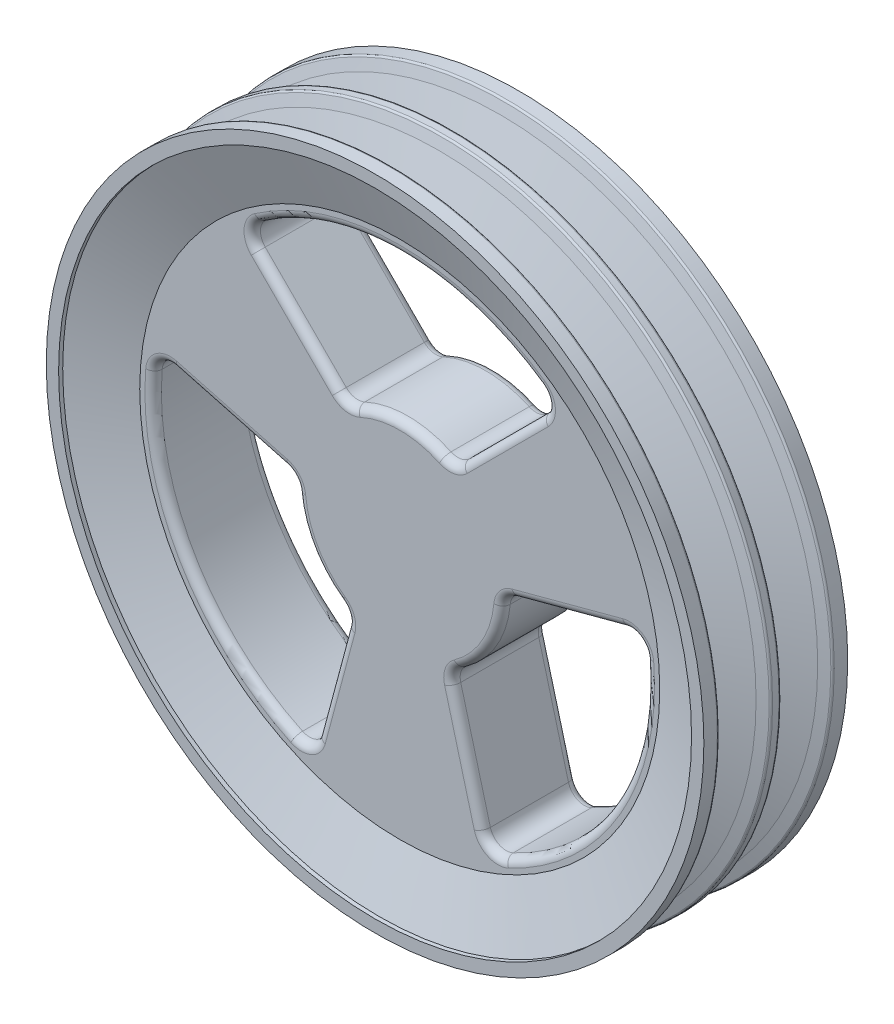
ISO-10303-21;
HEADER;
FILE_DESCRIPTION(('STEP AP214'),'2;1');
FILE_NAME('part.step','',(''),(''),'','','');
FILE_SCHEMA(('AUTOMOTIVE_DESIGN { 1 0 10303 214 1 1 1 1 }'));
ENDSEC;
DATA;
#1=APPLICATION_CONTEXT('core data for automotive mechanical design processes');
#2=APPLICATION_PROTOCOL_DEFINITION('international standard','automotive_design',2000,#1);
#3=PRODUCT_CONTEXT('',#1,'mechanical');
#4=PRODUCT('Part','Part','',(#3));
#5=PRODUCT_RELATED_PRODUCT_CATEGORY('part','',(#4));
#6=PRODUCT_DEFINITION_FORMATION('','',#4);
#7=PRODUCT_DEFINITION_CONTEXT('part definition',#1,'design');
#8=PRODUCT_DEFINITION('design','',#6,#7);
#9=PRODUCT_DEFINITION_SHAPE('','',#8);
#10=(LENGTH_UNIT() NAMED_UNIT(*) SI_UNIT(.MILLI.,.METRE.));
#11=(NAMED_UNIT(*) PLANE_ANGLE_UNIT() SI_UNIT($,.RADIAN.));
#12=(NAMED_UNIT(*) SI_UNIT($,.STERADIAN.) SOLID_ANGLE_UNIT());
#13=UNCERTAINTY_MEASURE_WITH_UNIT(LENGTH_MEASURE(1.E-05),#10,'distance_accuracy_value','');
#14=(GEOMETRIC_REPRESENTATION_CONTEXT(3) GLOBAL_UNCERTAINTY_ASSIGNED_CONTEXT((#13)) GLOBAL_UNIT_ASSIGNED_CONTEXT((#10,
#11,#12)) REPRESENTATION_CONTEXT('',''));
#15=CARTESIAN_POINT('',(0.,0.,0.));
#16=DIRECTION('',(0.,0.,1.));
#17=DIRECTION('',(1.,0.,0.));
#18=AXIS2_PLACEMENT_3D('',#15,#16,#17);
#19=CARTESIAN_POINT('',(0.,0.,-17.5));
#20=DIRECTION('',(0.,0.,1.));
#21=DIRECTION('',(1.,0.,0.));
#22=AXIS2_PLACEMENT_3D('',#19,#20,#21);
#23=PLANE('',#22);
#24=CARTESIAN_POINT('',(0.,0.,-17.5));
#25=DIRECTION('',(0.,0.,1.));
#26=DIRECTION('',(1.,0.,0.));
#27=AXIS2_PLACEMENT_3D('',#24,#25,#26);
#28=CIRCLE('',#27,80.);
#29=CARTESIAN_POINT('',(80.,0.,-17.5));
#30=VERTEX_POINT('',#29);
#31=EDGE_CURVE('E825',#30,#30,#28,.T.);
#32=ORIENTED_EDGE('',*,*,#31,.F.);
#33=EDGE_LOOP('',(#32));
#34=FACE_BOUND('',#33,.T.);
#35=CARTESIAN_POINT('',(0.,0.,-17.5));
#36=DIRECTION('',(0.,0.,1.));
#37=DIRECTION('',(1.,0.,0.));
#38=AXIS2_PLACEMENT_3D('',#35,#36,#37);
#39=CIRCLE('',#38,77.);
#40=CARTESIAN_POINT('',(77.,0.,-17.5));
#41=VERTEX_POINT('',#40);
#42=EDGE_CURVE('E801',#41,#41,#39,.T.);
#43=ORIENTED_EDGE('',*,*,#42,.T.);
#44=EDGE_LOOP('',(#43));
#45=FACE_BOUND('',#44,.T.);
#46=ADVANCED_FACE('F35',(#34,#45),#23,.F.);
#47=CARTESIAN_POINT('',(0.,0.,17.5));
#48=DIRECTION('',(0.,0.,1.));
#49=DIRECTION('',(1.,0.,0.));
#50=AXIS2_PLACEMENT_3D('',#47,#48,#49);
#51=PLANE('',#50);
#52=CARTESIAN_POINT('',(0.,0.,17.5));
#53=DIRECTION('',(0.,0.,1.));
#54=DIRECTION('',(1.,0.,0.));
#55=AXIS2_PLACEMENT_3D('',#52,#53,#54);
#56=CIRCLE('',#55,80.);
#57=CARTESIAN_POINT('',(80.,0.,17.5));
#58=VERTEX_POINT('',#57);
#59=EDGE_CURVE('E826',#58,#58,#56,.T.);
#60=ORIENTED_EDGE('',*,*,#59,.T.);
#61=EDGE_LOOP('',(#60));
#62=FACE_BOUND('',#61,.T.);
#63=CARTESIAN_POINT('',(0.,0.,17.5));
#64=DIRECTION('',(0.,0.,1.));
#65=DIRECTION('',(1.,0.,0.));
#66=AXIS2_PLACEMENT_3D('',#63,#64,#65);
#67=CIRCLE('',#66,77.);
#68=CARTESIAN_POINT('',(77.,0.,17.5));
#69=VERTEX_POINT('',#68);
#70=EDGE_CURVE('E804',#69,#69,#67,.T.);
#71=ORIENTED_EDGE('',*,*,#70,.F.);
#72=EDGE_LOOP('',(#71));
#73=FACE_BOUND('',#72,.T.);
#74=ADVANCED_FACE('F898',(#62,#73),#51,.T.);
#75=CARTESIAN_POINT('',(0.,0.,17.5));
#76=DIRECTION('',(0.,0.,-1.));
#77=DIRECTION('',(-1.,0.,0.));
#78=AXIS2_PLACEMENT_3D('',#75,#76,#77);
#79=CYLINDRICAL_SURFACE('',#78,80.);
#80=CARTESIAN_POINT('',(0.,0.,-0.779254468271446));
#81=DIRECTION('',(0.,0.,-1.));
#82=DIRECTION('',(-1.,0.,0.));
#83=AXIS2_PLACEMENT_3D('',#80,#81,#82);
#84=CIRCLE('',#83,80.);
#85=CARTESIAN_POINT('',(-80.,0.,-0.779254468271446));
#86=VERTEX_POINT('',#85);
#87=EDGE_CURVE('E861',#86,#86,#84,.F.);
#88=ORIENTED_EDGE('',*,*,#87,.T.);
#89=EDGE_LOOP('',(#88));
#90=FACE_BOUND('',#89,.T.);
#91=CARTESIAN_POINT('',(0.,0.,0.77925446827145));
#92=DIRECTION('',(0.,0.,-1.));
#93=DIRECTION('',(-1.,0.,0.));
#94=AXIS2_PLACEMENT_3D('',#91,#92,#93);
#95=CIRCLE('',#94,80.);
#96=CARTESIAN_POINT('',(-80.,0.,0.77925446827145));
#97=VERTEX_POINT('',#96);
#98=EDGE_CURVE('E834',#97,#97,#95,.T.);
#99=ORIENTED_EDGE('',*,*,#98,.T.);
#100=EDGE_LOOP('',(#99));
#101=FACE_BOUND('',#100,.T.);
#102=ADVANCED_FACE('F904',(#90,#101),#79,.T.);
#103=CARTESIAN_POINT('',(0.,0.,14.2207455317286));
#104=DIRECTION('',(0.,0.,-1.));
#105=DIRECTION('',(-1.,0.,0.));
#106=AXIS2_PLACEMENT_3D('',#103,#104,#105);
#107=CIRCLE('',#106,80.);
#108=CARTESIAN_POINT('',(-80.,0.,14.2207455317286));
#109=VERTEX_POINT('',#108);
#110=EDGE_CURVE('E837',#109,#109,#107,.F.);
#111=ORIENTED_EDGE('',*,*,#110,.T.);
#112=EDGE_LOOP('',(#111));
#113=FACE_BOUND('',#112,.T.);
#114=ORIENTED_EDGE('',*,*,#59,.F.);
#115=EDGE_LOOP('',(#114));
#116=FACE_BOUND('',#115,.T.);
#117=ADVANCED_FACE('F911',(#113,#116),#79,.T.);
#118=CARTESIAN_POINT('',(0.,0.,13.85));
#119=DIRECTION('',(0.,0.,1.));
#120=DIRECTION('',(1.,0.,0.));
#121=AXIS2_PLACEMENT_3D('',#118,#119,#120);
#122=CONICAL_SURFACE('',#121,80.,1.27606622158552);
#123=CARTESIAN_POINT('',(0.,0.,13.7423052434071));
#124=DIRECTION('',(0.,0.,1.));
#125=DIRECTION('',(1.,0.,0.));
#126=AXIS2_PLACEMENT_3D('',#123,#124,#125);
#127=CIRCLE('',#126,79.6452408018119);
#128=CARTESIAN_POINT('',(79.6452408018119,0.,13.7423052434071));
#129=VERTEX_POINT('',#128);
#130=EDGE_CURVE('E840',#129,#129,#127,.F.);
#131=ORIENTED_EDGE('',*,*,#130,.T.);
#132=EDGE_LOOP('',(#131));
#133=FACE_BOUND('',#132,.T.);
#134=CARTESIAN_POINT('',(0.,0.,13.));
#135=DIRECTION('',(0.,0.,1.));
#136=DIRECTION('',(1.,0.,0.));
#137=AXIS2_PLACEMENT_3D('',#134,#135,#136);
#138=CIRCLE('',#137,77.2);
#139=CARTESIAN_POINT('',(77.2,0.,13.));
#140=VERTEX_POINT('',#139);
#141=EDGE_CURVE('E822',#140,#140,#138,.T.);
#142=ORIENTED_EDGE('',*,*,#141,.T.);
#143=EDGE_LOOP('',(#142));
#144=FACE_BOUND('',#143,.T.);
#145=ADVANCED_FACE('F914',(#133,#144),#122,.T.);
#146=CARTESIAN_POINT('',(0.,0.,13.));
#147=DIRECTION('',(0.,0.,1.));
#148=DIRECTION('',(1.,0.,0.));
#149=AXIS2_PLACEMENT_3D('',#146,#147,#148);
#150=CONICAL_SURFACE('',#149,77.2,1.23918376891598);
#151=CARTESIAN_POINT('',(0.,0.,9.32850900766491));
#152=DIRECTION('',(0.,0.,1.));
#153=DIRECTION('',(1.,0.,0.));
#154=AXIS2_PLACEMENT_3D('',#151,#152,#153);
#155=CIRCLE('',#154,66.5372159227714);
#156=CARTESIAN_POINT('',(66.5372159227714,0.,9.32850900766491));
#157=VERTEX_POINT('',#156);
#158=EDGE_CURVE('E852',#157,#157,#155,.T.);
#159=ORIENTED_EDGE('',*,*,#158,.T.);
#160=EDGE_LOOP('',(#159));
#161=FACE_BOUND('',#160,.T.);
#162=ORIENTED_EDGE('',*,*,#141,.F.);
#163=EDGE_LOOP('',(#162));
#164=FACE_BOUND('',#163,.T.);
#165=ADVANCED_FACE('F966',(#161,#164),#150,.T.);
#166=CARTESIAN_POINT('',(0.,0.,17.5));
#167=DIRECTION('',(0.,0.,1.));
#168=DIRECTION('',(1.,0.,0.));
#169=AXIS2_PLACEMENT_3D('',#166,#167,#168);
#170=CYLINDRICAL_SURFACE('',#169,66.2);
#171=CARTESIAN_POINT('',(0.,0.,6.1442502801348));
#172=DIRECTION('',(0.,0.,1.));
#173=DIRECTION('',(1.,0.,0.));
#174=AXIS2_PLACEMENT_3D('',#171,#172,#173);
#175=CIRCLE('',#174,66.2);
#176=CARTESIAN_POINT('',(66.2,0.,6.1442502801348));
#177=VERTEX_POINT('',#176);
#178=EDGE_CURVE('E846',#177,#177,#175,.T.);
#179=ORIENTED_EDGE('',*,*,#178,.T.);
#180=EDGE_LOOP('',(#179));
#181=FACE_BOUND('',#180,.T.);
#182=CARTESIAN_POINT('',(0.,0.,8.8557497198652));
#183=DIRECTION('',(0.,0.,1.));
#184=DIRECTION('',(1.,0.,0.));
#185=AXIS2_PLACEMENT_3D('',#182,#183,#184);
#186=CIRCLE('',#185,66.2);
#187=CARTESIAN_POINT('',(66.2,0.,8.8557497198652));
#188=VERTEX_POINT('',#187);
#189=EDGE_CURVE('E843',#188,#188,#186,.F.);
#190=ORIENTED_EDGE('',*,*,#189,.T.);
#191=EDGE_LOOP('',(#190));
#192=FACE_BOUND('',#191,.T.);
#193=ADVANCED_FACE('F960',(#181,#192),#170,.T.);
#194=CARTESIAN_POINT('',(0.,0.,5.78760374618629));
#195=DIRECTION('',(0.,0.,-1.));
#196=DIRECTION('',(-1.,0.,0.));
#197=AXIS2_PLACEMENT_3D('',#194,#195,#196);
#198=CONICAL_SURFACE('',#197,66.2,1.23918376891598);
#199=CARTESIAN_POINT('',(0.,0.,5.6714909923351));
#200=DIRECTION('',(0.,0.,-1.));
#201=DIRECTION('',(-1.,0.,0.));
#202=AXIS2_PLACEMENT_3D('',#199,#200,#201);
#203=CIRCLE('',#202,66.5372159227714);
#204=CARTESIAN_POINT('',(-66.5372159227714,0.,5.6714909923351));
#205=VERTEX_POINT('',#204);
#206=EDGE_CURVE('E849',#205,#205,#203,.T.);
#207=ORIENTED_EDGE('',*,*,#206,.T.);
#208=EDGE_LOOP('',(#207));
#209=FACE_BOUND('',#208,.T.);
#210=CARTESIAN_POINT('',(0.,0.,2.));
#211=DIRECTION('',(0.,0.,1.));
#212=DIRECTION('',(1.,0.,0.));
#213=AXIS2_PLACEMENT_3D('',#210,#211,#212);
#214=CIRCLE('',#213,77.2);
#215=CARTESIAN_POINT('',(77.2,0.,2.));
#216=VERTEX_POINT('',#215);
#217=EDGE_CURVE('E819',#216,#216,#214,.T.);
#218=ORIENTED_EDGE('',*,*,#217,.T.);
#219=EDGE_LOOP('',(#218));
#220=FACE_BOUND('',#219,.T.);
#221=ADVANCED_FACE('F955',(#209,#220),#198,.T.);
#222=CARTESIAN_POINT('',(0.,0.,2.));
#223=DIRECTION('',(0.,0.,-1.));
#224=DIRECTION('',(-1.,0.,0.));
#225=AXIS2_PLACEMENT_3D('',#222,#223,#224);
#226=CONICAL_SURFACE('',#225,77.2,1.27606622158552);
#227=CARTESIAN_POINT('',(0.,0.,1.25769475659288));
#228=DIRECTION('',(0.,0.,-1.));
#229=DIRECTION('',(-1.,0.,0.));
#230=AXIS2_PLACEMENT_3D('',#227,#228,#229);
#231=CIRCLE('',#230,79.6452408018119);
#232=CARTESIAN_POINT('',(-79.6452408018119,0.,1.25769475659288));
#233=VERTEX_POINT('',#232);
#234=EDGE_CURVE('E829',#233,#233,#231,.F.);
#235=ORIENTED_EDGE('',*,*,#234,.T.);
#236=EDGE_LOOP('',(#235));
#237=FACE_BOUND('',#236,.T.);
#238=ORIENTED_EDGE('',*,*,#217,.F.);
#239=EDGE_LOOP('',(#238));
#240=FACE_BOUND('',#239,.T.);
#241=ADVANCED_FACE('F921',(#237,#240),#226,.T.);
#242=CARTESIAN_POINT('',(0.,0.,0.77925446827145));
#243=DIRECTION('',(0.,0.,-1.));
#244=DIRECTION('',(-1.,0.,0.));
#245=AXIS2_PLACEMENT_3D('',#242,#243,#244);
#246=TOROIDAL_SURFACE('',#245,79.5,0.5);
#247=ORIENTED_EDGE('',*,*,#98,.F.);
#248=EDGE_LOOP('',(#247));
#249=FACE_BOUND('',#248,.T.);
#250=ORIENTED_EDGE('',*,*,#234,.F.);
#251=EDGE_LOOP('',(#250));
#252=FACE_BOUND('',#251,.T.);
#253=ADVANCED_FACE('F917',(#249,#252),#246,.T.);
#254=CARTESIAN_POINT('',(0.,0.,14.2207455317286));
#255=DIRECTION('',(0.,0.,-1.));
#256=DIRECTION('',(-1.,0.,0.));
#257=AXIS2_PLACEMENT_3D('',#254,#255,#256);
#258=TOROIDAL_SURFACE('',#257,79.5,0.5);
#259=ORIENTED_EDGE('',*,*,#130,.F.);
#260=EDGE_LOOP('',(#259));
#261=FACE_BOUND('',#260,.T.);
#262=ORIENTED_EDGE('',*,*,#110,.F.);
#263=EDGE_LOOP('',(#262));
#264=FACE_BOUND('',#263,.T.);
#265=ADVANCED_FACE('F920',(#261,#264),#258,.T.);
#266=CARTESIAN_POINT('',(0.,0.,6.1442502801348));
#267=DIRECTION('',(0.,0.,1.));
#268=DIRECTION('',(1.,0.,0.));
#269=AXIS2_PLACEMENT_3D('',#266,#267,#268);
#270=TOROIDAL_SURFACE('',#269,66.7,0.5);
#271=ORIENTED_EDGE('',*,*,#206,.F.);
#272=EDGE_LOOP('',(#271));
#273=FACE_BOUND('',#272,.T.);
#274=ORIENTED_EDGE('',*,*,#178,.F.);
#275=EDGE_LOOP('',(#274));
#276=FACE_BOUND('',#275,.T.);
#277=ADVANCED_FACE('F925',(#273,#276),#270,.F.);
#278=CARTESIAN_POINT('',(0.,0.,8.8557497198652));
#279=DIRECTION('',(0.,0.,1.));
#280=DIRECTION('',(1.,0.,0.));
#281=AXIS2_PLACEMENT_3D('',#278,#279,#280);
#282=TOROIDAL_SURFACE('',#281,66.7,0.5);
#283=ORIENTED_EDGE('',*,*,#189,.F.);
#284=EDGE_LOOP('',(#283));
#285=FACE_BOUND('',#284,.T.);
#286=ORIENTED_EDGE('',*,*,#158,.F.);
#287=EDGE_LOOP('',(#286));
#288=FACE_BOUND('',#287,.T.);
#289=ADVANCED_FACE('F929',(#285,#288),#282,.F.);
#290=CARTESIAN_POINT('',(0.,0.,-1.15));
#291=DIRECTION('',(0.,0.,1.));
#292=DIRECTION('',(1.,0.,0.));
#293=AXIS2_PLACEMENT_3D('',#290,#291,#292);
#294=CONICAL_SURFACE('',#293,80.,1.27606622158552);
#295=CARTESIAN_POINT('',(0.,0.,-1.25769475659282));
#296=DIRECTION('',(0.,0.,1.));
#297=DIRECTION('',(1.,0.,0.));
#298=AXIS2_PLACEMENT_3D('',#295,#296,#297);
#299=CIRCLE('',#298,79.6452408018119);
#300=CARTESIAN_POINT('',(79.6452408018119,0.,-1.25769475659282));
#301=VERTEX_POINT('',#300);
#302=EDGE_CURVE('E864',#301,#301,#299,.F.);
#303=ORIENTED_EDGE('',*,*,#302,.T.);
#304=EDGE_LOOP('',(#303));
#305=FACE_BOUND('',#304,.T.);
#306=CARTESIAN_POINT('',(0.,0.,-2.));
#307=DIRECTION('',(0.,0.,1.));
#308=DIRECTION('',(1.,0.,0.));
#309=AXIS2_PLACEMENT_3D('',#306,#307,#308);
#310=CIRCLE('',#309,77.2);
#311=CARTESIAN_POINT('',(77.2,0.,-2.));
#312=VERTEX_POINT('',#311);
#313=EDGE_CURVE('E816',#312,#312,#310,.T.);
#314=ORIENTED_EDGE('',*,*,#313,.T.);
#315=EDGE_LOOP('',(#314));
#316=FACE_BOUND('',#315,.T.);
#317=ADVANCED_FACE('F933',(#305,#316),#294,.T.);
#318=CARTESIAN_POINT('',(0.,0.,-2.));
#319=DIRECTION('',(0.,0.,1.));
#320=DIRECTION('',(1.,0.,0.));
#321=AXIS2_PLACEMENT_3D('',#318,#319,#320);
#322=CONICAL_SURFACE('',#321,77.2,1.23918376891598);
#323=CARTESIAN_POINT('',(0.,0.,-5.6714909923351));
#324=DIRECTION('',(0.,0.,1.));
#325=DIRECTION('',(1.,0.,0.));
#326=AXIS2_PLACEMENT_3D('',#323,#324,#325);
#327=CIRCLE('',#326,66.5372159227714);
#328=CARTESIAN_POINT('',(66.5372159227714,0.,-5.6714909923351));
#329=VERTEX_POINT('',#328);
#330=EDGE_CURVE('E386',#329,#329,#327,.T.);
#331=ORIENTED_EDGE('',*,*,#330,.T.);
#332=EDGE_LOOP('',(#331));
#333=FACE_BOUND('',#332,.T.);
#334=ORIENTED_EDGE('',*,*,#313,.F.);
#335=EDGE_LOOP('',(#334));
#336=FACE_BOUND('',#335,.T.);
#337=ADVANCED_FACE('F878',(#333,#336),#322,.T.);
#338=CARTESIAN_POINT('',(0.,0.,2.5));
#339=DIRECTION('',(0.,0.,1.));
#340=DIRECTION('',(1.,0.,0.));
#341=AXIS2_PLACEMENT_3D('',#338,#339,#340);
#342=CYLINDRICAL_SURFACE('',#341,66.2);
#343=CARTESIAN_POINT('',(0.,0.,-8.8557497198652));
#344=DIRECTION('',(0.,0.,1.));
#345=DIRECTION('',(1.,0.,0.));
#346=AXIS2_PLACEMENT_3D('',#343,#344,#345);
#347=CIRCLE('',#346,66.2);
#348=CARTESIAN_POINT('',(66.2,0.,-8.8557497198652));
#349=VERTEX_POINT('',#348);
#350=EDGE_CURVE('E870',#349,#349,#347,.T.);
#351=ORIENTED_EDGE('',*,*,#350,.T.);
#352=EDGE_LOOP('',(#351));
#353=FACE_BOUND('',#352,.T.);
#354=CARTESIAN_POINT('',(0.,0.,-6.1442502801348));
#355=DIRECTION('',(0.,0.,1.));
#356=DIRECTION('',(1.,0.,0.));
#357=AXIS2_PLACEMENT_3D('',#354,#355,#356);
#358=CIRCLE('',#357,66.2);
#359=CARTESIAN_POINT('',(66.2,0.,-6.1442502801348));
#360=VERTEX_POINT('',#359);
#361=EDGE_CURVE('E867',#360,#360,#358,.F.);
#362=ORIENTED_EDGE('',*,*,#361,.T.);
#363=EDGE_LOOP('',(#362));
#364=FACE_BOUND('',#363,.T.);
#365=ADVANCED_FACE('F1011',(#353,#364),#342,.T.);
#366=CARTESIAN_POINT('',(0.,0.,-9.21239625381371));
#367=DIRECTION('',(0.,0.,-1.));
#368=DIRECTION('',(-1.,0.,0.));
#369=AXIS2_PLACEMENT_3D('',#366,#367,#368);
#370=CONICAL_SURFACE('',#369,66.2,1.23918376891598);
#371=CARTESIAN_POINT('',(0.,0.,-9.32850900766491));
#372=DIRECTION('',(0.,0.,-1.));
#373=DIRECTION('',(-1.,0.,0.));
#374=AXIS2_PLACEMENT_3D('',#371,#372,#373);
#375=CIRCLE('',#374,66.5372159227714);
#376=CARTESIAN_POINT('',(-66.5372159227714,0.,-9.32850900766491));
#377=VERTEX_POINT('',#376);
#378=EDGE_CURVE('E873',#377,#377,#375,.T.);
#379=ORIENTED_EDGE('',*,*,#378,.T.);
#380=EDGE_LOOP('',(#379));
#381=FACE_BOUND('',#380,.T.);
#382=CARTESIAN_POINT('',(0.,0.,-13.));
#383=DIRECTION('',(0.,0.,1.));
#384=DIRECTION('',(1.,0.,0.));
#385=AXIS2_PLACEMENT_3D('',#382,#383,#384);
#386=CIRCLE('',#385,77.2);
#387=CARTESIAN_POINT('',(77.2,0.,-13.));
#388=VERTEX_POINT('',#387);
#389=EDGE_CURVE('E813',#388,#388,#386,.T.);
#390=ORIENTED_EDGE('',*,*,#389,.T.);
#391=EDGE_LOOP('',(#390));
#392=FACE_BOUND('',#391,.T.);
#393=ADVANCED_FACE('F1007',(#381,#392),#370,.T.);
#394=CARTESIAN_POINT('',(0.,0.,-13.));
#395=DIRECTION('',(0.,0.,-1.));
#396=DIRECTION('',(-1.,0.,0.));
#397=AXIS2_PLACEMENT_3D('',#394,#395,#396);
#398=CONICAL_SURFACE('',#397,77.2,1.27606622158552);
#399=CARTESIAN_POINT('',(0.,0.,-13.7423052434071));
#400=DIRECTION('',(0.,0.,-1.));
#401=DIRECTION('',(-1.,0.,0.));
#402=AXIS2_PLACEMENT_3D('',#399,#400,#401);
#403=CIRCLE('',#402,79.6452408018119);
#404=CARTESIAN_POINT('',(-79.6452408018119,0.,-13.7423052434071));
#405=VERTEX_POINT('',#404);
#406=EDGE_CURVE('E855',#405,#405,#403,.F.);
#407=ORIENTED_EDGE('',*,*,#406,.T.);
#408=EDGE_LOOP('',(#407));
#409=FACE_BOUND('',#408,.T.);
#410=ORIENTED_EDGE('',*,*,#389,.F.);
#411=EDGE_LOOP('',(#410));
#412=FACE_BOUND('',#411,.T.);
#413=ADVANCED_FACE('F1004',(#409,#412),#398,.T.);
#414=CARTESIAN_POINT('',(0.,0.,-14.2207455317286));
#415=DIRECTION('',(0.,0.,-1.));
#416=DIRECTION('',(-1.,0.,0.));
#417=AXIS2_PLACEMENT_3D('',#414,#415,#416);
#418=CIRCLE('',#417,80.);
#419=CARTESIAN_POINT('',(-80.,0.,-14.2207455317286));
#420=VERTEX_POINT('',#419);
#421=EDGE_CURVE('E858',#420,#420,#418,.T.);
#422=ORIENTED_EDGE('',*,*,#421,.T.);
#423=EDGE_LOOP('',(#422));
#424=FACE_BOUND('',#423,.T.);
#425=ORIENTED_EDGE('',*,*,#31,.T.);
#426=EDGE_LOOP('',(#425));
#427=FACE_BOUND('',#426,.T.);
#428=ADVANCED_FACE('F916',(#424,#427),#79,.T.);
#429=CARTESIAN_POINT('',(0.,0.,-14.2207455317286));
#430=DIRECTION('',(0.,0.,-1.));
#431=DIRECTION('',(-1.,0.,0.));
#432=AXIS2_PLACEMENT_3D('',#429,#430,#431);
#433=TOROIDAL_SURFACE('',#432,79.5,0.5);
#434=ORIENTED_EDGE('',*,*,#421,.F.);
#435=EDGE_LOOP('',(#434));
#436=FACE_BOUND('',#435,.T.);
#437=ORIENTED_EDGE('',*,*,#406,.F.);
#438=EDGE_LOOP('',(#437));
#439=FACE_BOUND('',#438,.T.);
#440=ADVANCED_FACE('F935',(#436,#439),#433,.T.);
#441=CARTESIAN_POINT('',(0.,0.,-0.779254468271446));
#442=DIRECTION('',(0.,0.,-1.));
#443=DIRECTION('',(-1.,0.,0.));
#444=AXIS2_PLACEMENT_3D('',#441,#442,#443);
#445=TOROIDAL_SURFACE('',#444,79.5,0.5);
#446=ORIENTED_EDGE('',*,*,#302,.F.);
#447=EDGE_LOOP('',(#446));
#448=FACE_BOUND('',#447,.T.);
#449=ORIENTED_EDGE('',*,*,#87,.F.);
#450=EDGE_LOOP('',(#449));
#451=FACE_BOUND('',#450,.T.);
#452=ADVANCED_FACE('F892',(#448,#451),#445,.T.);
#453=CARTESIAN_POINT('',(0.,0.,-8.8557497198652));
#454=DIRECTION('',(0.,0.,1.));
#455=DIRECTION('',(1.,0.,0.));
#456=AXIS2_PLACEMENT_3D('',#453,#454,#455);
#457=TOROIDAL_SURFACE('',#456,66.7,0.5);
#458=ORIENTED_EDGE('',*,*,#378,.F.);
#459=EDGE_LOOP('',(#458));
#460=FACE_BOUND('',#459,.T.);
#461=ORIENTED_EDGE('',*,*,#350,.F.);
#462=EDGE_LOOP('',(#461));
#463=FACE_BOUND('',#462,.T.);
#464=ADVANCED_FACE('F883',(#460,#463),#457,.F.);
#465=CARTESIAN_POINT('',(0.,0.,-6.1442502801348));
#466=DIRECTION('',(0.,0.,1.));
#467=DIRECTION('',(1.,0.,0.));
#468=AXIS2_PLACEMENT_3D('',#465,#466,#467);
#469=TOROIDAL_SURFACE('',#468,66.7,0.5);
#470=ORIENTED_EDGE('',*,*,#361,.F.);
#471=EDGE_LOOP('',(#470));
#472=FACE_BOUND('',#471,.T.);
#473=ORIENTED_EDGE('',*,*,#330,.F.);
#474=EDGE_LOOP('',(#473));
#475=FACE_BOUND('',#474,.T.);
#476=ADVANCED_FACE('F881',(#472,#475),#469,.F.);
#477=CARTESIAN_POINT('',(0.,0.,11.5));
#478=DIRECTION('',(0.,0.,1.));
#479=DIRECTION('',(1.,0.,0.));
#480=AXIS2_PLACEMENT_3D('',#477,#478,#479);
#481=PLANE('',#480);
#482=DIRECTION('',(0.25881904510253,0.965925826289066,0.));
#483=VECTOR('',#482,1.);
#484=CARTESIAN_POINT('',(-18.1246092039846,-52.1871491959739,11.5));
#485=LINE('',#484,#483);
#486=CARTESIAN_POINT('',(-10.9090981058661,-25.2584951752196,11.5));
#487=VERTEX_POINT('',#486);
#488=CARTESIAN_POINT('',(-18.1246092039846,-52.1871491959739,11.5));
#489=VERTEX_POINT('',#488);
#490=EDGE_CURVE('E646',#487,#489,#485,.F.);
#491=ORIENTED_EDGE('',*,*,#490,.T.);
#492=CARTESIAN_POINT('',(-23.920164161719,-50.6342349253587,11.5));
#493=DIRECTION('',(0.,0.,1.));
#494=DIRECTION('',(1.,0.,0.));
#495=AXIS2_PLACEMENT_3D('',#492,#493,#494);
#496=CIRCLE('',#495,6.);
#497=CARTESIAN_POINT('',(-26.4830388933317,-56.0593315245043,11.5));
#498=VERTEX_POINT('',#497);
#499=EDGE_CURVE('E659',#489,#498,#496,.F.);
#500=ORIENTED_EDGE('',*,*,#499,.T.);
#501=CARTESIAN_POINT('',(0.,0.,11.5));
#502=DIRECTION('',(0.,0.,1.));
#503=DIRECTION('',(1.,0.,0.));
#504=AXIS2_PLACEMENT_3D('',#501,#502,#503);
#505=CIRCLE('',#504,62.);
#506=CARTESIAN_POINT('',(-61.7903246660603,5.09468131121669,11.5));
#507=VERTEX_POINT('',#506);
#508=EDGE_CURVE('E59',#498,#507,#505,.F.);
#509=ORIENTED_EDGE('',*,*,#508,.T.);
#510=CARTESIAN_POINT('',(-55.8106158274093,4.60164763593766,11.5));
#511=DIRECTION('',(0.,0.,1.));
#512=DIRECTION('',(1.,0.,0.));
#513=AXIS2_PLACEMENT_3D('',#510,#511,#512);
#514=CIRCLE('',#513,6.);
#515=CARTESIAN_POINT('',(-54.2577015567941,10.3972025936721,11.5));
#516=VERTEX_POINT('',#515);
#517=EDGE_CURVE('E656',#507,#516,#514,.F.);
#518=ORIENTED_EDGE('',*,*,#517,.T.);
#519=DIRECTION('',(-0.965925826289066,0.25881904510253,0.));
#520=VECTOR('',#519,1.);
#521=CARTESIAN_POINT('',(-27.3290475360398,3.18169149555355,11.5));
#522=LINE('',#521,#520);
#523=CARTESIAN_POINT('',(-27.3290475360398,3.18169149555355,11.5));
#524=VERTEX_POINT('',#523);
#525=EDGE_CURVE('E654',#516,#524,#522,.F.);
#526=ORIENTED_EDGE('',*,*,#525,.T.);
#527=CARTESIAN_POINT('',(-28.881961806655,-2.61386346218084,11.5));
#528=DIRECTION('',(0.,0.,1.));
#529=DIRECTION('',(1.,0.,0.));
#530=AXIS2_PLACEMENT_3D('',#527,#528,#529);
#531=CIRCLE('',#530,6.);
#532=CARTESIAN_POINT('',(-22.9063835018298,-2.07306412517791,11.5));
#533=VERTEX_POINT('',#532);
#534=EDGE_CURVE('E652',#524,#533,#531,.F.);
#535=ORIENTED_EDGE('',*,*,#534,.T.);
#536=CARTESIAN_POINT('',(0.,0.,11.5));
#537=DIRECTION('',(0.,0.,1.));
#538=DIRECTION('',(1.,0.,0.));
#539=AXIS2_PLACEMENT_3D('',#536,#537,#538);
#540=CIRCLE('',#539,23.);
#541=CARTESIAN_POINT('',(-13.2485179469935,-18.8009779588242,11.5));
#542=VERTEX_POINT('',#541);
#543=EDGE_CURVE('E650',#533,#542,#540,.T.);
#544=ORIENTED_EDGE('',*,*,#543,.T.);
#545=CARTESIAN_POINT('',(-16.7046530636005,-23.7055809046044,11.5));
#546=DIRECTION('',(0.,0.,1.));
#547=DIRECTION('',(1.,0.,0.));
#548=AXIS2_PLACEMENT_3D('',#545,#546,#547);
#549=CIRCLE('',#548,6.);
#550=EDGE_CURVE('E648',#542,#487,#549,.F.);
#551=ORIENTED_EDGE('',*,*,#550,.T.);
#552=EDGE_LOOP('',(#491,#500,#509,#518,#526,#535,#544,#551));
#553=FACE_BOUND('',#552,.T.);
#554=DIRECTION('',(-0.965925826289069,-0.258819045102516,0.));
#555=VECTOR('',#554,1.);
#556=CARTESIAN_POINT('',(54.2577015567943,10.3972025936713,11.5));
#557=LINE('',#556,#555);
#558=CARTESIAN_POINT('',(27.3290475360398,3.18169149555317,11.5));
#559=VERTEX_POINT('',#558);
#560=CARTESIAN_POINT('',(54.2577015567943,10.3972025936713,11.5));
#561=VERTEX_POINT('',#560);
#562=EDGE_CURVE('E532',#559,#561,#557,.F.);
#563=ORIENTED_EDGE('',*,*,#562,.T.);
#564=CARTESIAN_POINT('',(55.8106158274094,4.60164763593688,11.5));
#565=DIRECTION('',(0.,0.,1.));
#566=DIRECTION('',(1.,0.,0.));
#567=AXIS2_PLACEMENT_3D('',#564,#565,#566);
#568=CIRCLE('',#567,6.);
#569=CARTESIAN_POINT('',(61.7903246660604,5.09468131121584,11.5));
#570=VERTEX_POINT('',#569);
#571=EDGE_CURVE('E546',#561,#570,#568,.F.);
#572=ORIENTED_EDGE('',*,*,#571,.T.);
#573=CARTESIAN_POINT('',(0.,0.,11.5));
#574=DIRECTION('',(0.,0.,1.));
#575=DIRECTION('',(1.,0.,0.));
#576=AXIS2_PLACEMENT_3D('',#573,#574,#575);
#577=CIRCLE('',#576,62.);
#578=CARTESIAN_POINT('',(26.4830388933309,-56.0593315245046,11.5));
#579=VERTEX_POINT('',#578);
#580=EDGE_CURVE('E544',#570,#579,#577,.F.);
#581=ORIENTED_EDGE('',*,*,#580,.T.);
#582=CARTESIAN_POINT('',(23.9201641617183,-50.634234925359,11.5));
#583=DIRECTION('',(0.,0.,1.));
#584=DIRECTION('',(1.,0.,0.));
#585=AXIS2_PLACEMENT_3D('',#582,#583,#584);
#586=CIRCLE('',#585,6.);
#587=CARTESIAN_POINT('',(18.1246092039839,-52.1871491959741,11.5));
#588=VERTEX_POINT('',#587);
#589=EDGE_CURVE('E542',#579,#588,#586,.F.);
#590=ORIENTED_EDGE('',*,*,#589,.T.);
#591=DIRECTION('',(0.258819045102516,-0.96592582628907,0.));
#592=VECTOR('',#591,1.);
#593=CARTESIAN_POINT('',(10.9090981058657,-25.2584951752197,11.5));
#594=LINE('',#593,#592);
#595=CARTESIAN_POINT('',(10.9090981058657,-25.2584951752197,11.5));
#596=VERTEX_POINT('',#595);
#597=EDGE_CURVE('E540',#588,#596,#594,.F.);
#598=ORIENTED_EDGE('',*,*,#597,.T.);
#599=CARTESIAN_POINT('',(16.7046530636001,-23.7055809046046,11.5));
#600=DIRECTION('',(0.,0.,1.));
#601=DIRECTION('',(1.,0.,0.));
#602=AXIS2_PLACEMENT_3D('',#599,#600,#601);
#603=CIRCLE('',#602,6.);
#604=CARTESIAN_POINT('',(13.2485179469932,-18.8009779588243,11.5));
#605=VERTEX_POINT('',#604);
#606=EDGE_CURVE('E538',#596,#605,#603,.F.);
#607=ORIENTED_EDGE('',*,*,#606,.T.);
#608=CARTESIAN_POINT('',(0.,0.,11.5));
#609=DIRECTION('',(0.,0.,1.));
#610=DIRECTION('',(1.,0.,0.));
#611=AXIS2_PLACEMENT_3D('',#608,#609,#610);
#612=CIRCLE('',#611,23.);
#613=CARTESIAN_POINT('',(22.9063835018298,-2.07306412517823,11.5));
#614=VERTEX_POINT('',#613);
#615=EDGE_CURVE('E536',#605,#614,#612,.T.);
#616=ORIENTED_EDGE('',*,*,#615,.T.);
#617=CARTESIAN_POINT('',(28.8819618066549,-2.61386346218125,11.5));
#618=DIRECTION('',(0.,0.,1.));
#619=DIRECTION('',(1.,0.,0.));
#620=AXIS2_PLACEMENT_3D('',#617,#618,#619);
#621=CIRCLE('',#620,6.);
#622=EDGE_CURVE('E534',#614,#559,#621,.F.);
#623=ORIENTED_EDGE('',*,*,#622,.T.);
#624=EDGE_LOOP('',(#563,#572,#581,#590,#598,#607,#616,#623));
#625=FACE_BOUND('',#624,.T.);
#626=DIRECTION('',(0.707106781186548,-0.707106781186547,0.));
#627=VECTOR('',#626,1.);
#628=CARTESIAN_POINT('',(-36.1330923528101,41.7899466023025,11.5));
#629=LINE('',#628,#627);
#630=CARTESIAN_POINT('',(-16.419949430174,22.0768036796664,11.5));
#631=VERTEX_POINT('',#630);
#632=CARTESIAN_POINT('',(-36.1330923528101,41.7899466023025,11.5));
#633=VERTEX_POINT('',#632);
#634=EDGE_CURVE('E423',#631,#633,#629,.F.);
#635=ORIENTED_EDGE('',*,*,#634,.T.);
#636=CARTESIAN_POINT('',(-31.8904516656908,46.0325872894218,11.5));
#637=DIRECTION('',(0.,0.,1.));
#638=DIRECTION('',(1.,0.,0.));
#639=AXIS2_PLACEMENT_3D('',#636,#637,#638);
#640=CIRCLE('',#639,6.);
#641=CARTESIAN_POINT('',(-35.3072857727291,50.9646502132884,11.5));
#642=VERTEX_POINT('',#641);
#643=EDGE_CURVE('E437',#633,#642,#640,.F.);
#644=ORIENTED_EDGE('',*,*,#643,.T.);
#645=CARTESIAN_POINT('',(0.,0.,11.5));
#646=DIRECTION('',(0.,0.,1.));
#647=DIRECTION('',(1.,0.,0.));
#648=AXIS2_PLACEMENT_3D('',#645,#646,#647);
#649=CIRCLE('',#648,62.);
#650=CARTESIAN_POINT('',(35.3072857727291,50.9646502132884,11.5));
#651=VERTEX_POINT('',#650);
#652=EDGE_CURVE('E435',#642,#651,#649,.F.);
#653=ORIENTED_EDGE('',*,*,#652,.T.);
#654=CARTESIAN_POINT('',(31.8904516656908,46.0325872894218,11.5));
#655=DIRECTION('',(0.,0.,1.));
#656=DIRECTION('',(1.,0.,0.));
#657=AXIS2_PLACEMENT_3D('',#654,#655,#656);
#658=CIRCLE('',#657,6.);
#659=CARTESIAN_POINT('',(36.1330923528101,41.7899466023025,11.5));
#660=VERTEX_POINT('',#659);
#661=EDGE_CURVE('E433',#651,#660,#658,.F.);
#662=ORIENTED_EDGE('',*,*,#661,.T.);
#663=DIRECTION('',(0.707106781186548,0.707106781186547,0.));
#664=VECTOR('',#663,1.);
#665=CARTESIAN_POINT('',(16.419949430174,22.0768036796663,11.5));
#666=LINE('',#665,#664);
#667=CARTESIAN_POINT('',(16.419949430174,22.0768036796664,11.5));
#668=VERTEX_POINT('',#667);
#669=EDGE_CURVE('E431',#660,#668,#666,.F.);
#670=ORIENTED_EDGE('',*,*,#669,.T.);
#671=CARTESIAN_POINT('',(12.1773087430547,26.3194443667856,11.5));
#672=DIRECTION('',(0.,0.,1.));
#673=DIRECTION('',(1.,0.,0.));
#674=AXIS2_PLACEMENT_3D('',#671,#672,#673);
#675=CIRCLE('',#674,6.);
#676=CARTESIAN_POINT('',(9.65786555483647,20.8740420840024,11.5));
#677=VERTEX_POINT('',#676);
#678=EDGE_CURVE('E429',#668,#677,#675,.F.);
#679=ORIENTED_EDGE('',*,*,#678,.T.);
#680=CARTESIAN_POINT('',(0.,0.,11.5));
#681=DIRECTION('',(0.,0.,1.));
#682=DIRECTION('',(1.,0.,0.));
#683=AXIS2_PLACEMENT_3D('',#680,#681,#682);
#684=CIRCLE('',#683,23.);
#685=CARTESIAN_POINT('',(-9.65786555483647,20.8740420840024,11.5));
#686=VERTEX_POINT('',#685);
#687=EDGE_CURVE('E427',#677,#686,#684,.T.);
#688=ORIENTED_EDGE('',*,*,#687,.T.);
#689=CARTESIAN_POINT('',(-12.1773087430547,26.3194443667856,11.5));
#690=DIRECTION('',(0.,0.,1.));
#691=DIRECTION('',(1.,0.,0.));
#692=AXIS2_PLACEMENT_3D('',#689,#690,#691);
#693=CIRCLE('',#692,6.);
#694=EDGE_CURVE('E425',#686,#631,#693,.F.);
#695=ORIENTED_EDGE('',*,*,#694,.T.);
#696=EDGE_LOOP('',(#635,#644,#653,#662,#670,#679,#688,#695));
#697=FACE_BOUND('',#696,.T.);
#698=CARTESIAN_POINT('',(0.,0.,11.5));
#699=DIRECTION('',(0.,0.,1.));
#700=DIRECTION('',(1.,0.,0.));
#701=AXIS2_PLACEMENT_3D('',#698,#699,#700);
#702=CIRCLE('',#701,63.2626129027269);
#703=CARTESIAN_POINT('',(63.2626129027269,0.,11.5));
#704=VERTEX_POINT('',#703);
#705=EDGE_CURVE('E810',#704,#704,#702,.T.);
#706=ORIENTED_EDGE('',*,*,#705,.T.);
#707=EDGE_LOOP('',(#706));
#708=FACE_BOUND('',#707,.T.);
#709=ADVANCED_FACE('F713',(#553,#625,#697,#708),#481,.T.);
#710=CARTESIAN_POINT('',(0.,0.,11.5));
#711=DIRECTION('',(0.,0.,1.));
#712=DIRECTION('',(1.,0.,0.));
#713=AXIS2_PLACEMENT_3D('',#710,#711,#712);
#714=CONICAL_SURFACE('',#713,63.2626129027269,1.22173047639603);
#715=CARTESIAN_POINT('',(0.,0.,16.5));
#716=DIRECTION('',(0.,0.,1.));
#717=DIRECTION('',(1.,0.,0.));
#718=AXIS2_PLACEMENT_3D('',#715,#716,#717);
#719=CIRCLE('',#718,77.);
#720=CARTESIAN_POINT('',(77.,0.,16.5));
#721=VERTEX_POINT('',#720);
#722=EDGE_CURVE('E807',#721,#721,#719,.T.);
#723=ORIENTED_EDGE('',*,*,#722,.T.);
#724=EDGE_LOOP('',(#723));
#725=FACE_BOUND('',#724,.T.);
#726=ORIENTED_EDGE('',*,*,#705,.F.);
#727=EDGE_LOOP('',(#726));
#728=FACE_BOUND('',#727,.T.);
#729=ADVANCED_FACE('F890',(#725,#728),#714,.F.);
#730=CARTESIAN_POINT('',(0.,0.,0.77925446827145));
#731=DIRECTION('',(0.,0.,1.));
#732=DIRECTION('',(1.,0.,0.));
#733=AXIS2_PLACEMENT_3D('',#730,#731,#732);
#734=CYLINDRICAL_SURFACE('',#733,77.);
#735=ORIENTED_EDGE('',*,*,#70,.T.);
#736=EDGE_LOOP('',(#735));
#737=FACE_BOUND('',#736,.T.);
#738=ORIENTED_EDGE('',*,*,#722,.F.);
#739=EDGE_LOOP('',(#738));
#740=FACE_BOUND('',#739,.T.);
#741=ADVANCED_FACE('F988',(#737,#740),#734,.F.);
#742=CARTESIAN_POINT('',(0.,0.,0.77925446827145));
#743=DIRECTION('',(0.,0.,1.));
#744=DIRECTION('',(1.,0.,0.));
#745=AXIS2_PLACEMENT_3D('',#742,#743,#744);
#746=CYLINDRICAL_SURFACE('',#745,77.);
#747=CARTESIAN_POINT('',(0.,0.,-16.5));
#748=DIRECTION('',(0.,0.,1.));
#749=DIRECTION('',(1.,0.,0.));
#750=AXIS2_PLACEMENT_3D('',#747,#748,#749);
#751=CIRCLE('',#750,77.);
#752=CARTESIAN_POINT('',(77.,0.,-16.5));
#753=VERTEX_POINT('',#752);
#754=EDGE_CURVE('E798',#753,#753,#751,.T.);
#755=ORIENTED_EDGE('',*,*,#754,.T.);
#756=EDGE_LOOP('',(#755));
#757=FACE_BOUND('',#756,.T.);
#758=ORIENTED_EDGE('',*,*,#42,.F.);
#759=EDGE_LOOP('',(#758));
#760=FACE_BOUND('',#759,.T.);
#761=ADVANCED_FACE('F991',(#757,#760),#746,.F.);
#762=CARTESIAN_POINT('',(0.,0.,-16.5));
#763=DIRECTION('',(0.,0.,-1.));
#764=DIRECTION('',(-1.,0.,0.));
#765=AXIS2_PLACEMENT_3D('',#762,#763,#764);
#766=CONICAL_SURFACE('',#765,77.,1.22173047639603);
#767=CARTESIAN_POINT('',(0.,0.,-11.5));
#768=DIRECTION('',(0.,0.,1.));
#769=DIRECTION('',(1.,0.,0.));
#770=AXIS2_PLACEMENT_3D('',#767,#768,#769);
#771=CIRCLE('',#770,63.2626129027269);
#772=CARTESIAN_POINT('',(63.2626129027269,0.,-11.5));
#773=VERTEX_POINT('',#772);
#774=EDGE_CURVE('E782',#773,#773,#771,.T.);
#775=ORIENTED_EDGE('',*,*,#774,.T.);
#776=EDGE_LOOP('',(#775));
#777=FACE_BOUND('',#776,.T.);
#778=ORIENTED_EDGE('',*,*,#754,.F.);
#779=EDGE_LOOP('',(#778));
#780=FACE_BOUND('',#779,.T.);
#781=ADVANCED_FACE('F1096',(#777,#780),#766,.F.);
#782=CARTESIAN_POINT('',(0.,63.2626129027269,-11.5));
#783=DIRECTION('',(0.,0.,-1.));
#784=DIRECTION('',(-1.,0.,0.));
#785=AXIS2_PLACEMENT_3D('',#782,#783,#784);
#786=PLANE('',#785);
#787=DIRECTION('',(-0.25881904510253,-0.965925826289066,0.));
#788=VECTOR('',#787,1.);
#789=CARTESIAN_POINT('',(-10.9090981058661,-25.2584951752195,-11.5));
#790=LINE('',#789,#788);
#791=CARTESIAN_POINT('',(-18.1246092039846,-52.1871491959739,-11.5));
#792=VERTEX_POINT('',#791);
#793=CARTESIAN_POINT('',(-10.9090981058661,-25.2584951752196,-11.5));
#794=VERTEX_POINT('',#793);
#795=EDGE_CURVE('E604',#792,#794,#790,.F.);
#796=ORIENTED_EDGE('',*,*,#795,.T.);
#797=CARTESIAN_POINT('',(-16.7046530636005,-23.7055809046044,-11.5));
#798=DIRECTION('',(0.,0.,-1.));
#799=DIRECTION('',(-1.,0.,0.));
#800=AXIS2_PLACEMENT_3D('',#797,#798,#799);
#801=CIRCLE('',#800,6.);
#802=CARTESIAN_POINT('',(-13.2485179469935,-18.8009779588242,-11.5));
#803=VERTEX_POINT('',#802);
#804=EDGE_CURVE('E618',#794,#803,#801,.F.);
#805=ORIENTED_EDGE('',*,*,#804,.T.);
#806=CARTESIAN_POINT('',(0.,0.,-11.5));
#807=DIRECTION('',(0.,0.,-1.));
#808=DIRECTION('',(-1.,0.,0.));
#809=AXIS2_PLACEMENT_3D('',#806,#807,#808);
#810=CIRCLE('',#809,23.);
#811=CARTESIAN_POINT('',(-22.9063835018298,-2.07306412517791,-11.5));
#812=VERTEX_POINT('',#811);
#813=EDGE_CURVE('E616',#803,#812,#810,.T.);
#814=ORIENTED_EDGE('',*,*,#813,.T.);
#815=CARTESIAN_POINT('',(-28.881961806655,-2.61386346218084,-11.5));
#816=DIRECTION('',(0.,0.,-1.));
#817=DIRECTION('',(-1.,0.,0.));
#818=AXIS2_PLACEMENT_3D('',#815,#816,#817);
#819=CIRCLE('',#818,6.);
#820=CARTESIAN_POINT('',(-27.3290475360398,3.18169149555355,-11.5));
#821=VERTEX_POINT('',#820);
#822=EDGE_CURVE('E614',#812,#821,#819,.F.);
#823=ORIENTED_EDGE('',*,*,#822,.T.);
#824=DIRECTION('',(0.965925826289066,-0.25881904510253,0.));
#825=VECTOR('',#824,1.);
#826=CARTESIAN_POINT('',(-54.2577015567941,10.3972025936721,-11.5));
#827=LINE('',#826,#825);
#828=CARTESIAN_POINT('',(-54.2577015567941,10.3972025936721,-11.5));
#829=VERTEX_POINT('',#828);
#830=EDGE_CURVE('E612',#821,#829,#827,.F.);
#831=ORIENTED_EDGE('',*,*,#830,.T.);
#832=CARTESIAN_POINT('',(-55.8106158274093,4.60164763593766,-11.5));
#833=DIRECTION('',(0.,0.,-1.));
#834=DIRECTION('',(-1.,0.,0.));
#835=AXIS2_PLACEMENT_3D('',#832,#833,#834);
#836=CIRCLE('',#835,6.);
#837=CARTESIAN_POINT('',(-61.7903246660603,5.09468131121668,-11.5));
#838=VERTEX_POINT('',#837);
#839=EDGE_CURVE('E610',#829,#838,#836,.F.);
#840=ORIENTED_EDGE('',*,*,#839,.T.);
#841=CARTESIAN_POINT('',(0.,0.,-11.5));
#842=DIRECTION('',(0.,0.,-1.));
#843=DIRECTION('',(-1.,0.,0.));
#844=AXIS2_PLACEMENT_3D('',#841,#842,#843);
#845=CIRCLE('',#844,62.);
#846=CARTESIAN_POINT('',(-26.4830388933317,-56.0593315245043,-11.5));
#847=VERTEX_POINT('',#846);
#848=EDGE_CURVE('E608',#838,#847,#845,.F.);
#849=ORIENTED_EDGE('',*,*,#848,.T.);
#850=CARTESIAN_POINT('',(-23.920164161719,-50.6342349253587,-11.5));
#851=DIRECTION('',(0.,0.,-1.));
#852=DIRECTION('',(-1.,0.,0.));
#853=AXIS2_PLACEMENT_3D('',#850,#851,#852);
#854=CIRCLE('',#853,6.);
#855=EDGE_CURVE('E606',#847,#792,#854,.F.);
#856=ORIENTED_EDGE('',*,*,#855,.T.);
#857=EDGE_LOOP('',(#796,#805,#814,#823,#831,#840,#849,#856));
#858=FACE_BOUND('',#857,.T.);
#859=DIRECTION('',(0.965925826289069,0.258819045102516,0.));
#860=VECTOR('',#859,1.);
#861=CARTESIAN_POINT('',(27.3290475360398,3.18169149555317,-11.5));
#862=LINE('',#861,#860);
#863=CARTESIAN_POINT('',(54.2577015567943,10.3972025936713,-11.5));
#864=VERTEX_POINT('',#863);
#865=CARTESIAN_POINT('',(27.3290475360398,3.18169149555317,-11.5));
#866=VERTEX_POINT('',#865);
#867=EDGE_CURVE('E490',#864,#866,#862,.F.);
#868=ORIENTED_EDGE('',*,*,#867,.T.);
#869=CARTESIAN_POINT('',(28.8819618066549,-2.61386346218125,-11.5));
#870=DIRECTION('',(0.,0.,-1.));
#871=DIRECTION('',(-1.,0.,0.));
#872=AXIS2_PLACEMENT_3D('',#869,#870,#871);
#873=CIRCLE('',#872,6.);
#874=CARTESIAN_POINT('',(22.9063835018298,-2.07306412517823,-11.5));
#875=VERTEX_POINT('',#874);
#876=EDGE_CURVE('E504',#866,#875,#873,.F.);
#877=ORIENTED_EDGE('',*,*,#876,.T.);
#878=CARTESIAN_POINT('',(0.,0.,-11.5));
#879=DIRECTION('',(0.,0.,-1.));
#880=DIRECTION('',(-1.,0.,0.));
#881=AXIS2_PLACEMENT_3D('',#878,#879,#880);
#882=CIRCLE('',#881,23.);
#883=CARTESIAN_POINT('',(13.2485179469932,-18.8009779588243,-11.5));
#884=VERTEX_POINT('',#883);
#885=EDGE_CURVE('E502',#875,#884,#882,.T.);
#886=ORIENTED_EDGE('',*,*,#885,.T.);
#887=CARTESIAN_POINT('',(16.7046530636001,-23.7055809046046,-11.5));
#888=DIRECTION('',(0.,0.,-1.));
#889=DIRECTION('',(-1.,0.,0.));
#890=AXIS2_PLACEMENT_3D('',#887,#888,#889);
#891=CIRCLE('',#890,6.);
#892=CARTESIAN_POINT('',(10.9090981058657,-25.2584951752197,-11.5));
#893=VERTEX_POINT('',#892);
#894=EDGE_CURVE('E500',#884,#893,#891,.F.);
#895=ORIENTED_EDGE('',*,*,#894,.T.);
#896=DIRECTION('',(-0.258819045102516,0.96592582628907,0.));
#897=VECTOR('',#896,1.);
#898=CARTESIAN_POINT('',(18.1246092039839,-52.1871491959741,-11.5));
#899=LINE('',#898,#897);
#900=CARTESIAN_POINT('',(18.1246092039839,-52.1871491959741,-11.5));
#901=VERTEX_POINT('',#900);
#902=EDGE_CURVE('E498',#893,#901,#899,.F.);
#903=ORIENTED_EDGE('',*,*,#902,.T.);
#904=CARTESIAN_POINT('',(23.9201641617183,-50.634234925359,-11.5));
#905=DIRECTION('',(0.,0.,-1.));
#906=DIRECTION('',(-1.,0.,0.));
#907=AXIS2_PLACEMENT_3D('',#904,#905,#906);
#908=CIRCLE('',#907,6.);
#909=CARTESIAN_POINT('',(26.4830388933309,-56.0593315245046,-11.5));
#910=VERTEX_POINT('',#909);
#911=EDGE_CURVE('E496',#901,#910,#908,.F.);
#912=ORIENTED_EDGE('',*,*,#911,.T.);
#913=CARTESIAN_POINT('',(0.,0.,-11.5));
#914=DIRECTION('',(0.,0.,-1.));
#915=DIRECTION('',(-1.,0.,0.));
#916=AXIS2_PLACEMENT_3D('',#913,#914,#915);
#917=CIRCLE('',#916,62.);
#918=CARTESIAN_POINT('',(61.7903246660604,5.09468131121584,-11.5));
#919=VERTEX_POINT('',#918);
#920=EDGE_CURVE('E494',#910,#919,#917,.F.);
#921=ORIENTED_EDGE('',*,*,#920,.T.);
#922=CARTESIAN_POINT('',(55.8106158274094,4.60164763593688,-11.5));
#923=DIRECTION('',(0.,0.,-1.));
#924=DIRECTION('',(-1.,0.,0.));
#925=AXIS2_PLACEMENT_3D('',#922,#923,#924);
#926=CIRCLE('',#925,6.);
#927=EDGE_CURVE('E492',#919,#864,#926,.F.);
#928=ORIENTED_EDGE('',*,*,#927,.T.);
#929=EDGE_LOOP('',(#868,#877,#886,#895,#903,#912,#921,#928));
#930=FACE_BOUND('',#929,.T.);
#931=DIRECTION('',(-0.707106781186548,0.707106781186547,0.));
#932=VECTOR('',#931,1.);
#933=CARTESIAN_POINT('',(-16.419949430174,22.0768036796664,-11.5));
#934=LINE('',#933,#932);
#935=CARTESIAN_POINT('',(-36.1330923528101,41.7899466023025,-11.5));
#936=VERTEX_POINT('',#935);
#937=CARTESIAN_POINT('',(-16.419949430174,22.0768036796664,-11.5));
#938=VERTEX_POINT('',#937);
#939=EDGE_CURVE('E382',#936,#938,#934,.F.);
#940=ORIENTED_EDGE('',*,*,#939,.T.);
#941=CARTESIAN_POINT('',(-12.1773087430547,26.3194443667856,-11.5));
#942=DIRECTION('',(0.,0.,-1.));
#943=DIRECTION('',(-1.,0.,0.));
#944=AXIS2_PLACEMENT_3D('',#941,#942,#943);
#945=CIRCLE('',#944,6.);
#946=CARTESIAN_POINT('',(-9.65786555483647,20.8740420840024,-11.5));
#947=VERTEX_POINT('',#946);
#948=EDGE_CURVE('E400',#938,#947,#945,.F.);
#949=ORIENTED_EDGE('',*,*,#948,.T.);
#950=CARTESIAN_POINT('',(0.,0.,-11.5));
#951=DIRECTION('',(0.,0.,-1.));
#952=DIRECTION('',(-1.,0.,0.));
#953=AXIS2_PLACEMENT_3D('',#950,#951,#952);
#954=CIRCLE('',#953,23.);
#955=CARTESIAN_POINT('',(9.65786555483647,20.8740420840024,-11.5));
#956=VERTEX_POINT('',#955);
#957=EDGE_CURVE('E372',#947,#956,#954,.T.);
#958=ORIENTED_EDGE('',*,*,#957,.T.);
#959=CARTESIAN_POINT('',(12.1773087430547,26.3194443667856,-11.5));
#960=DIRECTION('',(0.,0.,-1.));
#961=DIRECTION('',(-1.,0.,0.));
#962=AXIS2_PLACEMENT_3D('',#959,#960,#961);
#963=CIRCLE('',#962,6.);
#964=CARTESIAN_POINT('',(16.419949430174,22.0768036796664,-11.5));
#965=VERTEX_POINT('',#964);
#966=EDGE_CURVE('E397',#956,#965,#963,.F.);
#967=ORIENTED_EDGE('',*,*,#966,.T.);
#968=DIRECTION('',(-0.707106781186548,-0.707106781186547,0.));
#969=VECTOR('',#968,1.);
#970=CARTESIAN_POINT('',(36.1330923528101,41.7899466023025,-11.5));
#971=LINE('',#970,#969);
#972=CARTESIAN_POINT('',(36.1330923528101,41.7899466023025,-11.5));
#973=VERTEX_POINT('',#972);
#974=EDGE_CURVE('E395',#965,#973,#971,.F.);
#975=ORIENTED_EDGE('',*,*,#974,.T.);
#976=CARTESIAN_POINT('',(31.8904516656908,46.0325872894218,-11.5));
#977=DIRECTION('',(0.,0.,-1.));
#978=DIRECTION('',(-1.,0.,0.));
#979=AXIS2_PLACEMENT_3D('',#976,#977,#978);
#980=CIRCLE('',#979,6.);
#981=CARTESIAN_POINT('',(35.3072857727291,50.9646502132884,-11.5));
#982=VERTEX_POINT('',#981);
#983=EDGE_CURVE('E393',#973,#982,#980,.F.);
#984=ORIENTED_EDGE('',*,*,#983,.T.);
#985=CARTESIAN_POINT('',(0.,0.,-11.5));
#986=DIRECTION('',(0.,0.,-1.));
#987=DIRECTION('',(-1.,0.,0.));
#988=AXIS2_PLACEMENT_3D('',#985,#986,#987);
#989=CIRCLE('',#988,62.);
#990=CARTESIAN_POINT('',(-35.3072857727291,50.9646502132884,-11.5));
#991=VERTEX_POINT('',#990);
#992=EDGE_CURVE('E391',#982,#991,#989,.F.);
#993=ORIENTED_EDGE('',*,*,#992,.T.);
#994=CARTESIAN_POINT('',(-31.8904516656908,46.0325872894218,-11.5));
#995=DIRECTION('',(0.,0.,-1.));
#996=DIRECTION('',(-1.,0.,0.));
#997=AXIS2_PLACEMENT_3D('',#994,#995,#996);
#998=CIRCLE('',#997,6.);
#999=EDGE_CURVE('E384',#991,#936,#998,.F.);
#1000=ORIENTED_EDGE('',*,*,#999,.T.);
#1001=EDGE_LOOP('',(#940,#949,#958,#967,#975,#984,#993,#1000));
#1002=FACE_BOUND('',#1001,.T.);
#1003=ORIENTED_EDGE('',*,*,#774,.F.);
#1004=EDGE_LOOP('',(#1003));
#1005=FACE_BOUND('',#1004,.T.);
#1006=ADVANCED_FACE('F1105',(#858,#930,#1002,#1005),#786,.T.);
#1007=CARTESIAN_POINT('',(-31.8904516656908,46.0325872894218,-17.5));
#1008=DIRECTION('',(0.,0.,1.));
#1009=DIRECTION('',(1.,0.,0.));
#1010=AXIS2_PLACEMENT_3D('',#1007,#1008,#1009);
#1011=CYLINDRICAL_SURFACE('',#1010,4.);
#1012=DIRECTION('',(0.,0.,1.));
#1013=VECTOR('',#1012,1.);
#1014=CARTESIAN_POINT('',(-34.718878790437,43.2041601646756,-17.5));
#1015=LINE('',#1014,#1013);
#1016=CARTESIAN_POINT('',(-34.718878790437,43.2041601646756,-9.50000000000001));
#1017=VERTEX_POINT('',#1016);
#1018=CARTESIAN_POINT('',(-34.718878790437,43.2041601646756,9.50000000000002));
#1019=VERTEX_POINT('',#1018);
#1020=EDGE_CURVE('E463',#1017,#1019,#1015,.T.);
#1021=ORIENTED_EDGE('',*,*,#1020,.F.);
#1022=CARTESIAN_POINT('',(-31.8904516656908,46.0325872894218,-9.50000000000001));
#1023=DIRECTION('',(0.,0.,-1.));
#1024=DIRECTION('',(-1.,0.,0.));
#1025=AXIS2_PLACEMENT_3D('',#1022,#1023,#1024);
#1026=CIRCLE('',#1025,4.);
#1027=CARTESIAN_POINT('',(-34.168341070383,49.3206292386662,-9.50000000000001));
#1028=VERTEX_POINT('',#1027);
#1029=EDGE_CURVE('E421',#1017,#1028,#1026,.T.);
#1030=ORIENTED_EDGE('',*,*,#1029,.T.);
#1031=DIRECTION('',(0.,0.,1.));
#1032=VECTOR('',#1031,1.);
#1033=CARTESIAN_POINT('',(-34.168341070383,49.3206292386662,-17.5));
#1034=LINE('',#1033,#1032);
#1035=CARTESIAN_POINT('',(-34.168341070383,49.3206292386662,9.50000000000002));
#1036=VERTEX_POINT('',#1035);
#1037=EDGE_CURVE('E779',#1028,#1036,#1034,.T.);
#1038=ORIENTED_EDGE('',*,*,#1037,.T.);
#1039=CARTESIAN_POINT('',(-31.8904516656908,46.0325872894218,9.50000000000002));
#1040=DIRECTION('',(0.,0.,1.));
#1041=DIRECTION('',(1.,0.,0.));
#1042=AXIS2_PLACEMENT_3D('',#1039,#1040,#1041);
#1043=CIRCLE('',#1042,4.);
#1044=EDGE_CURVE('E418',#1036,#1019,#1043,.T.);
#1045=ORIENTED_EDGE('',*,*,#1044,.T.);
#1046=EDGE_LOOP('',(#1021,#1030,#1038,#1045));
#1047=FACE_BOUND('',#1046,.T.);
#1048=ADVANCED_FACE('F1113',(#1047),#1011,.F.);
#1049=CARTESIAN_POINT('',(0.,0.,-17.5));
#1050=DIRECTION('',(0.,0.,1.));
#1051=DIRECTION('',(1.,0.,0.));
#1052=AXIS2_PLACEMENT_3D('',#1049,#1050,#1051);
#1053=CYLINDRICAL_SURFACE('',#1052,60.);
#1054=ORIENTED_EDGE('',*,*,#1037,.F.);
#1055=CARTESIAN_POINT('',(0.,0.,-9.50000000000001));
#1056=DIRECTION('',(0.,0.,-1.));
#1057=DIRECTION('',(-1.,0.,0.));
#1058=AXIS2_PLACEMENT_3D('',#1055,#1056,#1057);
#1059=CIRCLE('',#1058,60.);
#1060=CARTESIAN_POINT('',(34.168341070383,49.3206292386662,-9.50000000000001));
#1061=VERTEX_POINT('',#1060);
#1062=EDGE_CURVE('E416',#1028,#1061,#1059,.T.);
#1063=ORIENTED_EDGE('',*,*,#1062,.T.);
#1064=DIRECTION('',(0.,0.,1.));
#1065=VECTOR('',#1064,1.);
#1066=CARTESIAN_POINT('',(34.168341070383,49.3206292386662,-17.5));
#1067=LINE('',#1066,#1065);
#1068=CARTESIAN_POINT('',(34.168341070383,49.3206292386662,9.50000000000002));
#1069=VERTEX_POINT('',#1068);
#1070=EDGE_CURVE('E783',#1061,#1069,#1067,.T.);
#1071=ORIENTED_EDGE('',*,*,#1070,.T.);
#1072=CARTESIAN_POINT('',(0.,0.,9.50000000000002));
#1073=DIRECTION('',(0.,0.,1.));
#1074=DIRECTION('',(1.,0.,0.));
#1075=AXIS2_PLACEMENT_3D('',#1072,#1073,#1074);
#1076=CIRCLE('',#1075,60.);
#1077=EDGE_CURVE('E414',#1069,#1036,#1076,.T.);
#1078=ORIENTED_EDGE('',*,*,#1077,.T.);
#1079=EDGE_LOOP('',(#1054,#1063,#1071,#1078));
#1080=FACE_BOUND('',#1079,.T.);
#1081=ADVANCED_FACE('F1118',(#1080),#1053,.F.);
#1082=CARTESIAN_POINT('',(31.8904516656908,46.0325872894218,-17.5));
#1083=DIRECTION('',(0.,0.,1.));
#1084=DIRECTION('',(1.,0.,0.));
#1085=AXIS2_PLACEMENT_3D('',#1082,#1083,#1084);
#1086=CYLINDRICAL_SURFACE('',#1085,4.);
#1087=ORIENTED_EDGE('',*,*,#1070,.F.);
#1088=CARTESIAN_POINT('',(31.8904516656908,46.0325872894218,-9.50000000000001));
#1089=DIRECTION('',(0.,0.,-1.));
#1090=DIRECTION('',(-1.,0.,0.));
#1091=AXIS2_PLACEMENT_3D('',#1088,#1089,#1090);
#1092=CIRCLE('',#1091,4.);
#1093=CARTESIAN_POINT('',(34.718878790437,43.2041601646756,-9.50000000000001));
#1094=VERTEX_POINT('',#1093);
#1095=EDGE_CURVE('E412',#1061,#1094,#1092,.T.);
#1096=ORIENTED_EDGE('',*,*,#1095,.T.);
#1097=DIRECTION('',(0.,0.,1.));
#1098=VECTOR('',#1097,1.);
#1099=CARTESIAN_POINT('',(34.718878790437,43.2041601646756,-17.5));
#1100=LINE('',#1099,#1098);
#1101=CARTESIAN_POINT('',(34.718878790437,43.2041601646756,9.50000000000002));
#1102=VERTEX_POINT('',#1101);
#1103=EDGE_CURVE('E786',#1094,#1102,#1100,.T.);
#1104=ORIENTED_EDGE('',*,*,#1103,.T.);
#1105=CARTESIAN_POINT('',(31.8904516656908,46.0325872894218,9.50000000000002));
#1106=DIRECTION('',(0.,0.,1.));
#1107=DIRECTION('',(1.,0.,0.));
#1108=AXIS2_PLACEMENT_3D('',#1105,#1106,#1107);
#1109=CIRCLE('',#1108,4.);
#1110=EDGE_CURVE('E410',#1102,#1069,#1109,.T.);
#1111=ORIENTED_EDGE('',*,*,#1110,.T.);
#1112=EDGE_LOOP('',(#1087,#1096,#1104,#1111));
#1113=FACE_BOUND('',#1112,.T.);
#1114=ADVANCED_FACE('F1128',(#1113),#1086,.F.);
#1115=CARTESIAN_POINT('',(15.0057358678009,23.4910172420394,-17.5));
#1116=DIRECTION('',(0.707106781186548,-0.707106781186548,0.));
#1117=DIRECTION('',(0.707106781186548,0.707106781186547,0.));
#1118=AXIS2_PLACEMENT_3D('',#1115,#1116,#1117);
#1119=PLANE('',#1118);
#1120=ORIENTED_EDGE('',*,*,#1103,.F.);
#1121=DIRECTION('',(-0.707106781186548,-0.707106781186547,0.));
#1122=VECTOR('',#1121,1.);
#1123=CARTESIAN_POINT('',(15.0057358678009,23.4910172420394,-9.50000000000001));
#1124=LINE('',#1123,#1122);
#1125=CARTESIAN_POINT('',(15.0057358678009,23.4910172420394,-9.50000000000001));
#1126=VERTEX_POINT('',#1125);
#1127=EDGE_CURVE('E408',#1094,#1126,#1124,.T.);
#1128=ORIENTED_EDGE('',*,*,#1127,.T.);
#1129=DIRECTION('',(0.,0.,1.));
#1130=VECTOR('',#1129,1.);
#1131=CARTESIAN_POINT('',(15.0057358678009,23.4910172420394,-17.5));
#1132=LINE('',#1131,#1130);
#1133=CARTESIAN_POINT('',(15.0057358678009,23.4910172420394,9.50000000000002));
#1134=VERTEX_POINT('',#1133);
#1135=EDGE_CURVE('E789',#1126,#1134,#1132,.T.);
#1136=ORIENTED_EDGE('',*,*,#1135,.T.);
#1137=DIRECTION('',(0.707106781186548,0.707106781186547,0.));
#1138=VECTOR('',#1137,1.);
#1139=CARTESIAN_POINT('',(34.718878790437,43.2041601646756,9.50000000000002));
#1140=LINE('',#1139,#1138);
#1141=EDGE_CURVE('E406',#1134,#1102,#1140,.T.);
#1142=ORIENTED_EDGE('',*,*,#1141,.T.);
#1143=EDGE_LOOP('',(#1120,#1128,#1136,#1142));
#1144=FACE_BOUND('',#1143,.T.);
#1145=ADVANCED_FACE('F1138',(#1144),#1119,.F.);
#1146=CARTESIAN_POINT('',(12.1773087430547,26.3194443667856,-17.5));
#1147=DIRECTION('',(0.,0.,1.));
#1148=DIRECTION('',(1.,0.,0.));
#1149=AXIS2_PLACEMENT_3D('',#1146,#1147,#1148);
#1150=CYLINDRICAL_SURFACE('',#1149,4.);
#1151=ORIENTED_EDGE('',*,*,#1135,.F.);
#1152=CARTESIAN_POINT('',(12.1773087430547,26.3194443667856,-9.50000000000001));
#1153=DIRECTION('',(0.,0.,-1.));
#1154=DIRECTION('',(-1.,0.,0.));
#1155=AXIS2_PLACEMENT_3D('',#1152,#1153,#1154);
#1156=CIRCLE('',#1155,4.);
#1157=CARTESIAN_POINT('',(10.4976799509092,22.6891761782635,-9.50000000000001));
#1158=VERTEX_POINT('',#1157);
#1159=EDGE_CURVE('E404',#1126,#1158,#1156,.T.);
#1160=ORIENTED_EDGE('',*,*,#1159,.T.);
#1161=DIRECTION('',(0.,0.,1.));
#1162=VECTOR('',#1161,1.);
#1163=CARTESIAN_POINT('',(10.4976799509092,22.6891761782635,-17.5));
#1164=LINE('',#1163,#1162);
#1165=CARTESIAN_POINT('',(10.4976799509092,22.6891761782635,9.50000000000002));
#1166=VERTEX_POINT('',#1165);
#1167=EDGE_CURVE('E350',#1158,#1166,#1164,.T.);
#1168=ORIENTED_EDGE('',*,*,#1167,.T.);
#1169=CARTESIAN_POINT('',(12.1773087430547,26.3194443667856,9.50000000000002));
#1170=DIRECTION('',(0.,0.,1.));
#1171=DIRECTION('',(1.,0.,0.));
#1172=AXIS2_PLACEMENT_3D('',#1169,#1170,#1171);
#1173=CIRCLE('',#1172,4.);
#1174=EDGE_CURVE('E355',#1166,#1134,#1173,.T.);
#1175=ORIENTED_EDGE('',*,*,#1174,.T.);
#1176=EDGE_LOOP('',(#1151,#1160,#1168,#1175));
#1177=FACE_BOUND('',#1176,.T.);
#1178=ADVANCED_FACE('F1148',(#1177),#1150,.F.);
#1179=CARTESIAN_POINT('',(0.,0.,-17.5));
#1180=DIRECTION('',(0.,0.,1.));
#1181=DIRECTION('',(1.,0.,0.));
#1182=AXIS2_PLACEMENT_3D('',#1179,#1180,#1181);
#1183=CYLINDRICAL_SURFACE('',#1182,25.);
#1184=ORIENTED_EDGE('',*,*,#1167,.F.);
#1185=CARTESIAN_POINT('',(0.,0.,-9.50000000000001));
#1186=DIRECTION('',(0.,0.,-1.));
#1187=DIRECTION('',(-1.,0.,0.));
#1188=AXIS2_PLACEMENT_3D('',#1185,#1186,#1187);
#1189=CIRCLE('',#1188,25.);
#1190=CARTESIAN_POINT('',(-10.4976799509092,22.6891761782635,-9.50000000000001));
#1191=VERTEX_POINT('',#1190);
#1192=EDGE_CURVE('E344',#1158,#1191,#1189,.F.);
#1193=ORIENTED_EDGE('',*,*,#1192,.T.);
#1194=DIRECTION('',(0.,0.,1.));
#1195=VECTOR('',#1194,1.);
#1196=CARTESIAN_POINT('',(-10.4976799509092,22.6891761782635,-17.5));
#1197=LINE('',#1196,#1195);
#1198=CARTESIAN_POINT('',(-10.4976799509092,22.6891761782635,9.50000000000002));
#1199=VERTEX_POINT('',#1198);
#1200=EDGE_CURVE('E347',#1191,#1199,#1197,.T.);
#1201=ORIENTED_EDGE('',*,*,#1200,.T.);
#1202=CARTESIAN_POINT('',(0.,0.,9.50000000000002));
#1203=DIRECTION('',(0.,0.,1.));
#1204=DIRECTION('',(1.,0.,0.));
#1205=AXIS2_PLACEMENT_3D('',#1202,#1203,#1204);
#1206=CIRCLE('',#1205,25.);
#1207=EDGE_CURVE('E356',#1199,#1166,#1206,.F.);
#1208=ORIENTED_EDGE('',*,*,#1207,.T.);
#1209=EDGE_LOOP('',(#1184,#1193,#1201,#1208));
#1210=FACE_BOUND('',#1209,.T.);
#1211=ADVANCED_FACE('F346',(#1210),#1183,.T.);
#1212=CARTESIAN_POINT('',(-12.1773087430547,26.3194443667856,-17.5));
#1213=DIRECTION('',(0.,0.,1.));
#1214=DIRECTION('',(1.,0.,0.));
#1215=AXIS2_PLACEMENT_3D('',#1212,#1213,#1214);
#1216=CYLINDRICAL_SURFACE('',#1215,4.);
#1217=ORIENTED_EDGE('',*,*,#1200,.F.);
#1218=CARTESIAN_POINT('',(-12.1773087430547,26.3194443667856,-9.50000000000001));
#1219=DIRECTION('',(0.,0.,-1.));
#1220=DIRECTION('',(-1.,0.,0.));
#1221=AXIS2_PLACEMENT_3D('',#1218,#1219,#1220);
#1222=CIRCLE('',#1221,4.);
#1223=CARTESIAN_POINT('',(-15.0057358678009,23.4910172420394,-9.50000000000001));
#1224=VERTEX_POINT('',#1223);
#1225=EDGE_CURVE('E363',#1191,#1224,#1222,.T.);
#1226=ORIENTED_EDGE('',*,*,#1225,.T.);
#1227=DIRECTION('',(0.,0.,1.));
#1228=VECTOR('',#1227,1.);
#1229=CARTESIAN_POINT('',(-15.0057358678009,23.4910172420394,-17.5));
#1230=LINE('',#1229,#1228);
#1231=CARTESIAN_POINT('',(-15.0057358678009,23.4910172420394,9.50000000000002));
#1232=VERTEX_POINT('',#1231);
#1233=EDGE_CURVE('E367',#1224,#1232,#1230,.T.);
#1234=ORIENTED_EDGE('',*,*,#1233,.T.);
#1235=CARTESIAN_POINT('',(-12.1773087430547,26.3194443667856,9.50000000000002));
#1236=DIRECTION('',(0.,0.,1.));
#1237=DIRECTION('',(1.,0.,0.));
#1238=AXIS2_PLACEMENT_3D('',#1235,#1236,#1237);
#1239=CIRCLE('',#1238,4.);
#1240=EDGE_CURVE('E366',#1232,#1199,#1239,.T.);
#1241=ORIENTED_EDGE('',*,*,#1240,.T.);
#1242=EDGE_LOOP('',(#1217,#1226,#1234,#1241));
#1243=FACE_BOUND('',#1242,.T.);
#1244=ADVANCED_FACE('F360',(#1243),#1216,.F.);
#1245=CARTESIAN_POINT('',(-15.0057358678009,23.4910172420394,-17.5));
#1246=DIRECTION('',(-0.707106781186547,-0.707106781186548,0.));
#1247=DIRECTION('',(0.707106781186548,-0.707106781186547,0.));
#1248=AXIS2_PLACEMENT_3D('',#1245,#1246,#1247);
#1249=PLANE('',#1248);
#1250=ORIENTED_EDGE('',*,*,#1233,.F.);
#1251=DIRECTION('',(-0.707106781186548,0.707106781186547,0.));
#1252=VECTOR('',#1251,1.);
#1253=CARTESIAN_POINT('',(-34.718878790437,43.2041601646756,-9.50000000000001));
#1254=LINE('',#1253,#1252);
#1255=EDGE_CURVE('E442',#1224,#1017,#1254,.T.);
#1256=ORIENTED_EDGE('',*,*,#1255,.T.);
#1257=ORIENTED_EDGE('',*,*,#1020,.T.);
#1258=DIRECTION('',(0.707106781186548,-0.707106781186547,0.));
#1259=VECTOR('',#1258,1.);
#1260=CARTESIAN_POINT('',(-15.0057358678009,23.4910172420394,9.50000000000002));
#1261=LINE('',#1260,#1259);
#1262=EDGE_CURVE('E440',#1019,#1232,#1261,.T.);
#1263=ORIENTED_EDGE('',*,*,#1262,.T.);
#1264=EDGE_LOOP('',(#1250,#1256,#1257,#1263));
#1265=FACE_BOUND('',#1264,.T.);
#1266=ADVANCED_FACE('F1175',(#1265),#1249,.F.);
#1267=CARTESIAN_POINT('',(31.8904516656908,46.0325872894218,-9.50000000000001));
#1268=DIRECTION('',(0.,0.,-1.));
#1269=DIRECTION('',(-1.,0.,0.));
#1270=AXIS2_PLACEMENT_3D('',#1267,#1268,#1269);
#1271=TOROIDAL_SURFACE('',#1270,6.,2.);
#1272=CARTESIAN_POINT('',(35.3072857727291,50.9646502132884,-9.50000000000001));
#1273=DIRECTION('',(-0.822010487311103,0.569472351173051,0.));
#1274=DIRECTION('',(-0.569472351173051,-0.822010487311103,0.));
#1275=AXIS2_PLACEMENT_3D('',#1272,#1273,#1274);
#1276=CIRCLE('',#1275,2.);
#1277=EDGE_CURVE('E457',#982,#1061,#1276,.T.);
#1278=ORIENTED_EDGE('',*,*,#1277,.F.);
#1279=ORIENTED_EDGE('',*,*,#983,.F.);
#1280=CARTESIAN_POINT('',(36.1330923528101,41.7899466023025,-9.50000000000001));
#1281=DIRECTION('',(-0.707106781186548,-0.707106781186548,0.));
#1282=DIRECTION('',(0.707106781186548,-0.707106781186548,0.));
#1283=AXIS2_PLACEMENT_3D('',#1280,#1281,#1282);
#1284=CIRCLE('',#1283,2.);
#1285=EDGE_CURVE('E460',#1094,#973,#1284,.T.);
#1286=ORIENTED_EDGE('',*,*,#1285,.F.);
#1287=ORIENTED_EDGE('',*,*,#1095,.F.);
#1288=EDGE_LOOP('',(#1278,#1279,#1286,#1287));
#1289=FACE_BOUND('',#1288,.T.);
#1290=ADVANCED_FACE('F1184',(#1289),#1271,.T.);
#1291=CARTESIAN_POINT('',(16.419949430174,22.0768036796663,-9.50000000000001));
#1292=DIRECTION('',(0.707106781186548,0.707106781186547,0.));
#1293=DIRECTION('',(-0.707106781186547,0.707106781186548,0.));
#1294=AXIS2_PLACEMENT_3D('',#1291,#1292,#1293);
#1295=CYLINDRICAL_SURFACE('',#1294,2.);
#1296=ORIENTED_EDGE('',*,*,#1285,.T.);
#1297=ORIENTED_EDGE('',*,*,#974,.F.);
#1298=CARTESIAN_POINT('',(16.419949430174,22.0768036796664,-9.50000000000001));
#1299=DIRECTION('',(-0.707106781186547,-0.707106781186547,0.));
#1300=DIRECTION('',(0.707106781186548,-0.707106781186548,0.));
#1301=AXIS2_PLACEMENT_3D('',#1298,#1299,#1300);
#1302=CIRCLE('',#1301,2.);
#1303=EDGE_CURVE('E454',#1126,#965,#1302,.T.);
#1304=ORIENTED_EDGE('',*,*,#1303,.F.);
#1305=ORIENTED_EDGE('',*,*,#1127,.F.);
#1306=EDGE_LOOP('',(#1296,#1297,#1304,#1305));
#1307=FACE_BOUND('',#1306,.T.);
#1308=ADVANCED_FACE('F1194',(#1307),#1295,.T.);
#1309=CARTESIAN_POINT('',(0.,0.,-9.50000000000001));
#1310=DIRECTION('',(0.,0.,-1.));
#1311=DIRECTION('',(-1.,0.,0.));
#1312=AXIS2_PLACEMENT_3D('',#1309,#1310,#1311);
#1313=TOROIDAL_SURFACE('',#1312,62.,2.);
#1314=ORIENTED_EDGE('',*,*,#1277,.T.);
#1315=ORIENTED_EDGE('',*,*,#1062,.F.);
#1316=CARTESIAN_POINT('',(-35.3072857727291,50.9646502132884,-9.50000000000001));
#1317=DIRECTION('',(-0.822010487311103,-0.569472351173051,0.));
#1318=DIRECTION('',(0.569472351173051,-0.822010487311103,0.));
#1319=AXIS2_PLACEMENT_3D('',#1316,#1317,#1318);
#1320=CIRCLE('',#1319,2.);
#1321=EDGE_CURVE('E451',#991,#1028,#1320,.T.);
#1322=ORIENTED_EDGE('',*,*,#1321,.F.);
#1323=ORIENTED_EDGE('',*,*,#992,.F.);
#1324=EDGE_LOOP('',(#1314,#1315,#1322,#1323));
#1325=FACE_BOUND('',#1324,.T.);
#1326=ADVANCED_FACE('F1204',(#1325),#1313,.T.);
#1327=CARTESIAN_POINT('',(12.1773087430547,26.3194443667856,-9.50000000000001));
#1328=DIRECTION('',(0.,0.,-1.));
#1329=DIRECTION('',(-1.,0.,0.));
#1330=AXIS2_PLACEMENT_3D('',#1327,#1328,#1329);
#1331=TOROIDAL_SURFACE('',#1330,6.,2.);
#1332=ORIENTED_EDGE('',*,*,#1303,.T.);
#1333=ORIENTED_EDGE('',*,*,#966,.F.);
#1334=CARTESIAN_POINT('',(9.65786555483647,20.8740420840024,-9.50000000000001));
#1335=DIRECTION('',(-0.907567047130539,0.419907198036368,0.));
#1336=DIRECTION('',(-0.419907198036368,-0.907567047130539,0.));
#1337=AXIS2_PLACEMENT_3D('',#1334,#1335,#1336);
#1338=CIRCLE('',#1337,2.);
#1339=EDGE_CURVE('E449',#1158,#956,#1338,.T.);
#1340=ORIENTED_EDGE('',*,*,#1339,.F.);
#1341=ORIENTED_EDGE('',*,*,#1159,.F.);
#1342=EDGE_LOOP('',(#1332,#1333,#1340,#1341));
#1343=FACE_BOUND('',#1342,.T.);
#1344=ADVANCED_FACE('F1214',(#1343),#1331,.T.);
#1345=CARTESIAN_POINT('',(-31.8904516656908,46.0325872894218,-9.50000000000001));
#1346=DIRECTION('',(0.,0.,-1.));
#1347=DIRECTION('',(-1.,0.,0.));
#1348=AXIS2_PLACEMENT_3D('',#1345,#1346,#1347);
#1349=TOROIDAL_SURFACE('',#1348,6.,2.);
#1350=ORIENTED_EDGE('',*,*,#1321,.T.);
#1351=ORIENTED_EDGE('',*,*,#1029,.F.);
#1352=CARTESIAN_POINT('',(-36.1330923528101,41.7899466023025,-9.50000000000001));
#1353=DIRECTION('',(0.707106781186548,-0.707106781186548,0.));
#1354=DIRECTION('',(0.707106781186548,0.707106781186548,0.));
#1355=AXIS2_PLACEMENT_3D('',#1352,#1353,#1354);
#1356=CIRCLE('',#1355,2.);
#1357=EDGE_CURVE('E376',#936,#1017,#1356,.T.);
#1358=ORIENTED_EDGE('',*,*,#1357,.F.);
#1359=ORIENTED_EDGE('',*,*,#999,.F.);
#1360=EDGE_LOOP('',(#1350,#1351,#1358,#1359));
#1361=FACE_BOUND('',#1360,.T.);
#1362=ADVANCED_FACE('F1224',(#1361),#1349,.T.);
#1363=CARTESIAN_POINT('',(0.,0.,-9.50000000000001));
#1364=DIRECTION('',(0.,0.,-1.));
#1365=DIRECTION('',(-1.,0.,0.));
#1366=AXIS2_PLACEMENT_3D('',#1363,#1364,#1365);
#1367=TOROIDAL_SURFACE('',#1366,23.,2.);
#1368=ORIENTED_EDGE('',*,*,#1339,.T.);
#1369=ORIENTED_EDGE('',*,*,#957,.F.);
#1370=CARTESIAN_POINT('',(-9.65786555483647,20.8740420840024,-9.50000000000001));
#1371=DIRECTION('',(-0.907567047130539,-0.419907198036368,0.));
#1372=DIRECTION('',(0.419907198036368,-0.907567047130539,0.));
#1373=AXIS2_PLACEMENT_3D('',#1370,#1371,#1372);
#1374=CIRCLE('',#1373,2.);
#1375=EDGE_CURVE('E370',#1191,#947,#1374,.T.);
#1376=ORIENTED_EDGE('',*,*,#1375,.F.);
#1377=ORIENTED_EDGE('',*,*,#1192,.F.);
#1378=EDGE_LOOP('',(#1368,#1369,#1376,#1377));
#1379=FACE_BOUND('',#1378,.T.);
#1380=ADVANCED_FACE('F371',(#1379),#1367,.T.);
#1381=CARTESIAN_POINT('',(-16.419949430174,22.0768036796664,-9.50000000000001));
#1382=DIRECTION('',(0.707106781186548,-0.707106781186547,0.));
#1383=DIRECTION('',(0.707106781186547,0.707106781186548,0.));
#1384=AXIS2_PLACEMENT_3D('',#1381,#1382,#1383);
#1385=CYLINDRICAL_SURFACE('',#1384,2.);
#1386=ORIENTED_EDGE('',*,*,#1357,.T.);
#1387=ORIENTED_EDGE('',*,*,#1255,.F.);
#1388=CARTESIAN_POINT('',(-16.419949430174,22.0768036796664,-9.50000000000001));
#1389=DIRECTION('',(0.707106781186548,-0.707106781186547,0.));
#1390=DIRECTION('',(0.707106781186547,0.707106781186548,0.));
#1391=AXIS2_PLACEMENT_3D('',#1388,#1389,#1390);
#1392=CIRCLE('',#1391,2.);
#1393=EDGE_CURVE('E377',#938,#1224,#1392,.T.);
#1394=ORIENTED_EDGE('',*,*,#1393,.F.);
#1395=ORIENTED_EDGE('',*,*,#939,.F.);
#1396=EDGE_LOOP('',(#1386,#1387,#1394,#1395));
#1397=FACE_BOUND('',#1396,.T.);
#1398=ADVANCED_FACE('F1243',(#1397),#1385,.T.);
#1399=CARTESIAN_POINT('',(-12.1773087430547,26.3194443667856,-9.50000000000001));
#1400=DIRECTION('',(0.,0.,-1.));
#1401=DIRECTION('',(-1.,0.,0.));
#1402=AXIS2_PLACEMENT_3D('',#1399,#1400,#1401);
#1403=TOROIDAL_SURFACE('',#1402,6.,2.);
#1404=ORIENTED_EDGE('',*,*,#1375,.T.);
#1405=ORIENTED_EDGE('',*,*,#948,.F.);
#1406=ORIENTED_EDGE('',*,*,#1393,.T.);
#1407=ORIENTED_EDGE('',*,*,#1225,.F.);
#1408=EDGE_LOOP('',(#1404,#1405,#1406,#1407));
#1409=FACE_BOUND('',#1408,.T.);
#1410=ADVANCED_FACE('F379',(#1409),#1403,.T.);
#1411=CARTESIAN_POINT('',(12.1773087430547,26.3194443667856,9.50000000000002));
#1412=DIRECTION('',(0.,0.,1.));
#1413=DIRECTION('',(1.,0.,0.));
#1414=AXIS2_PLACEMENT_3D('',#1411,#1412,#1413);
#1415=TOROIDAL_SURFACE('',#1414,6.,2.);
#1416=CARTESIAN_POINT('',(9.65786555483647,20.8740420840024,9.50000000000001));
#1417=DIRECTION('',(-0.907567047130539,0.419907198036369,0.));
#1418=DIRECTION('',(-0.419907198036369,-0.907567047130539,0.));
#1419=AXIS2_PLACEMENT_3D('',#1416,#1417,#1418);
#1420=CIRCLE('',#1419,2.);
#1421=EDGE_CURVE('E481',#677,#1166,#1420,.T.);
#1422=ORIENTED_EDGE('',*,*,#1421,.F.);
#1423=ORIENTED_EDGE('',*,*,#678,.F.);
#1424=CARTESIAN_POINT('',(16.419949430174,22.0768036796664,9.50000000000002));
#1425=DIRECTION('',(0.707106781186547,0.707106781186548,0.));
#1426=DIRECTION('',(-0.707106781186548,0.707106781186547,0.));
#1427=AXIS2_PLACEMENT_3D('',#1424,#1425,#1426);
#1428=CIRCLE('',#1427,2.);
#1429=EDGE_CURVE('E445',#1134,#668,#1428,.T.);
#1430=ORIENTED_EDGE('',*,*,#1429,.F.);
#1431=ORIENTED_EDGE('',*,*,#1174,.F.);
#1432=EDGE_LOOP('',(#1422,#1423,#1430,#1431));
#1433=FACE_BOUND('',#1432,.T.);
#1434=ADVANCED_FACE('F1261',(#1433),#1415,.T.);
#1435=CARTESIAN_POINT('',(16.419949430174,22.0768036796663,9.50000000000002));
#1436=DIRECTION('',(-0.707106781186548,-0.707106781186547,0.));
#1437=DIRECTION('',(0.707106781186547,-0.707106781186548,0.));
#1438=AXIS2_PLACEMENT_3D('',#1435,#1436,#1437);
#1439=CYLINDRICAL_SURFACE('',#1438,2.);
#1440=ORIENTED_EDGE('',*,*,#1429,.T.);
#1441=ORIENTED_EDGE('',*,*,#669,.F.);
#1442=CARTESIAN_POINT('',(36.1330923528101,41.7899466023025,9.50000000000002));
#1443=DIRECTION('',(0.707106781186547,0.707106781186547,0.));
#1444=DIRECTION('',(-0.707106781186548,0.707106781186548,0.));
#1445=AXIS2_PLACEMENT_3D('',#1442,#1443,#1444);
#1446=CIRCLE('',#1445,2.);
#1447=EDGE_CURVE('E478',#1102,#660,#1446,.T.);
#1448=ORIENTED_EDGE('',*,*,#1447,.F.);
#1449=ORIENTED_EDGE('',*,*,#1141,.F.);
#1450=EDGE_LOOP('',(#1440,#1441,#1448,#1449));
#1451=FACE_BOUND('',#1450,.T.);
#1452=ADVANCED_FACE('F1269',(#1451),#1439,.T.);
#1453=CARTESIAN_POINT('',(0.,0.,9.50000000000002));
#1454=DIRECTION('',(0.,0.,1.));
#1455=DIRECTION('',(1.,0.,0.));
#1456=AXIS2_PLACEMENT_3D('',#1453,#1454,#1455);
#1457=TOROIDAL_SURFACE('',#1456,23.,2.);
#1458=ORIENTED_EDGE('',*,*,#1421,.T.);
#1459=ORIENTED_EDGE('',*,*,#1207,.F.);
#1460=CARTESIAN_POINT('',(-9.65786555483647,20.8740420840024,9.50000000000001));
#1461=DIRECTION('',(-0.907567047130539,-0.419907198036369,0.));
#1462=DIRECTION('',(0.419907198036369,-0.907567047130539,0.));
#1463=AXIS2_PLACEMENT_3D('',#1460,#1461,#1462);
#1464=CIRCLE('',#1463,2.);
#1465=EDGE_CURVE('E475',#686,#1199,#1464,.T.);
#1466=ORIENTED_EDGE('',*,*,#1465,.F.);
#1467=ORIENTED_EDGE('',*,*,#687,.F.);
#1468=EDGE_LOOP('',(#1458,#1459,#1466,#1467));
#1469=FACE_BOUND('',#1468,.T.);
#1470=ADVANCED_FACE('F1279',(#1469),#1457,.T.);
#1471=CARTESIAN_POINT('',(31.8904516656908,46.0325872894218,9.50000000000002));
#1472=DIRECTION('',(0.,0.,1.));
#1473=DIRECTION('',(1.,0.,0.));
#1474=AXIS2_PLACEMENT_3D('',#1471,#1472,#1473);
#1475=TOROIDAL_SURFACE('',#1474,6.,2.);
#1476=ORIENTED_EDGE('',*,*,#1447,.T.);
#1477=ORIENTED_EDGE('',*,*,#661,.F.);
#1478=CARTESIAN_POINT('',(35.3072857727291,50.9646502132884,9.50000000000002));
#1479=DIRECTION('',(-0.822010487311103,0.569472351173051,0.));
#1480=DIRECTION('',(-0.569472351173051,-0.822010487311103,0.));
#1481=AXIS2_PLACEMENT_3D('',#1478,#1479,#1480);
#1482=CIRCLE('',#1481,2.);
#1483=EDGE_CURVE('E472',#1069,#651,#1482,.T.);
#1484=ORIENTED_EDGE('',*,*,#1483,.F.);
#1485=ORIENTED_EDGE('',*,*,#1110,.F.);
#1486=EDGE_LOOP('',(#1476,#1477,#1484,#1485));
#1487=FACE_BOUND('',#1486,.T.);
#1488=ADVANCED_FACE('F1289',(#1487),#1475,.T.);
#1489=CARTESIAN_POINT('',(-12.1773087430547,26.3194443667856,9.50000000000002));
#1490=DIRECTION('',(0.,0.,1.));
#1491=DIRECTION('',(1.,0.,0.));
#1492=AXIS2_PLACEMENT_3D('',#1489,#1490,#1491);
#1493=TOROIDAL_SURFACE('',#1492,6.,2.);
#1494=ORIENTED_EDGE('',*,*,#1465,.T.);
#1495=ORIENTED_EDGE('',*,*,#1240,.F.);
#1496=CARTESIAN_POINT('',(-16.419949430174,22.0768036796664,9.50000000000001));
#1497=DIRECTION('',(-0.707106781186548,0.707106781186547,0.));
#1498=DIRECTION('',(-0.707106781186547,-0.707106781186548,0.));
#1499=AXIS2_PLACEMENT_3D('',#1496,#1497,#1498);
#1500=CIRCLE('',#1499,2.);
#1501=EDGE_CURVE('E469',#631,#1232,#1500,.T.);
#1502=ORIENTED_EDGE('',*,*,#1501,.F.);
#1503=ORIENTED_EDGE('',*,*,#694,.F.);
#1504=EDGE_LOOP('',(#1494,#1495,#1502,#1503));
#1505=FACE_BOUND('',#1504,.T.);
#1506=ADVANCED_FACE('F1299',(#1505),#1493,.T.);
#1507=CARTESIAN_POINT('',(0.,0.,9.50000000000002));
#1508=DIRECTION('',(0.,0.,1.));
#1509=DIRECTION('',(1.,0.,0.));
#1510=AXIS2_PLACEMENT_3D('',#1507,#1508,#1509);
#1511=TOROIDAL_SURFACE('',#1510,62.,2.);
#1512=ORIENTED_EDGE('',*,*,#1483,.T.);
#1513=ORIENTED_EDGE('',*,*,#652,.F.);
#1514=CARTESIAN_POINT('',(-35.3072857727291,50.9646502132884,9.50000000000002));
#1515=DIRECTION('',(-0.822010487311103,-0.569472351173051,0.));
#1516=DIRECTION('',(0.569472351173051,-0.822010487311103,0.));
#1517=AXIS2_PLACEMENT_3D('',#1514,#1515,#1516);
#1518=CIRCLE('',#1517,2.);
#1519=EDGE_CURVE('E466',#1036,#642,#1518,.T.);
#1520=ORIENTED_EDGE('',*,*,#1519,.F.);
#1521=ORIENTED_EDGE('',*,*,#1077,.F.);
#1522=EDGE_LOOP('',(#1512,#1513,#1520,#1521));
#1523=FACE_BOUND('',#1522,.T.);
#1524=ADVANCED_FACE('F1309',(#1523),#1511,.T.);
#1525=CARTESIAN_POINT('',(-16.419949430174,22.0768036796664,9.50000000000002));
#1526=DIRECTION('',(-0.707106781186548,0.707106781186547,0.));
#1527=DIRECTION('',(-0.707106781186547,-0.707106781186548,0.));
#1528=AXIS2_PLACEMENT_3D('',#1525,#1526,#1527);
#1529=CYLINDRICAL_SURFACE('',#1528,2.);
#1530=ORIENTED_EDGE('',*,*,#1501,.T.);
#1531=ORIENTED_EDGE('',*,*,#1262,.F.);
#1532=CARTESIAN_POINT('',(-36.1330923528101,41.7899466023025,9.50000000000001));
#1533=DIRECTION('',(-0.707106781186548,0.707106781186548,0.));
#1534=DIRECTION('',(-0.707106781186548,-0.707106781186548,0.));
#1535=AXIS2_PLACEMENT_3D('',#1532,#1533,#1534);
#1536=CIRCLE('',#1535,2.);
#1537=EDGE_CURVE('E464',#633,#1019,#1536,.T.);
#1538=ORIENTED_EDGE('',*,*,#1537,.F.);
#1539=ORIENTED_EDGE('',*,*,#634,.F.);
#1540=EDGE_LOOP('',(#1530,#1531,#1538,#1539));
#1541=FACE_BOUND('',#1540,.T.);
#1542=ADVANCED_FACE('F1319',(#1541),#1529,.T.);
#1543=CARTESIAN_POINT('',(-31.8904516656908,46.0325872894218,9.50000000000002));
#1544=DIRECTION('',(0.,0.,1.));
#1545=DIRECTION('',(1.,0.,0.));
#1546=AXIS2_PLACEMENT_3D('',#1543,#1544,#1545);
#1547=TOROIDAL_SURFACE('',#1546,6.,2.);
#1548=ORIENTED_EDGE('',*,*,#1519,.T.);
#1549=ORIENTED_EDGE('',*,*,#643,.F.);
#1550=ORIENTED_EDGE('',*,*,#1537,.T.);
#1551=ORIENTED_EDGE('',*,*,#1044,.F.);
#1552=EDGE_LOOP('',(#1548,#1549,#1550,#1551));
#1553=FACE_BOUND('',#1552,.T.);
#1554=ADVANCED_FACE('F1329',(#1553),#1547,.T.);
#1555=CARTESIAN_POINT('',(55.8106158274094,4.60164763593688,-17.5));
#1556=DIRECTION('',(0.,0.,1.));
#1557=DIRECTION('',(1.,0.,0.));
#1558=AXIS2_PLACEMENT_3D('',#1555,#1556,#1557);
#1559=CYLINDRICAL_SURFACE('',#1558,4.);
#1560=DIRECTION('',(0.,0.,1.));
#1561=VECTOR('',#1560,1.);
#1562=CARTESIAN_POINT('',(54.7753396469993,8.46535094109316,-17.5));
#1563=LINE('',#1562,#1561);
#1564=CARTESIAN_POINT('',(54.7753396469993,8.46535094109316,-9.50000000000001));
#1565=VERTEX_POINT('',#1564);
#1566=CARTESIAN_POINT('',(54.7753396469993,8.46535094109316,9.50000000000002));
#1567=VERTEX_POINT('',#1566);
#1568=EDGE_CURVE('E737',#1565,#1567,#1563,.T.);
#1569=ORIENTED_EDGE('',*,*,#1568,.F.);
#1570=CARTESIAN_POINT('',(55.8106158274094,4.60164763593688,-9.50000000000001));
#1571=DIRECTION('',(0.,0.,-1.));
#1572=DIRECTION('',(-1.,0.,0.));
#1573=AXIS2_PLACEMENT_3D('',#1570,#1571,#1572);
#1574=CIRCLE('',#1573,4.);
#1575=CARTESIAN_POINT('',(59.79708838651,4.93033675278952,-9.50000000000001));
#1576=VERTEX_POINT('',#1575);
#1577=EDGE_CURVE('E530',#1565,#1576,#1574,.T.);
#1578=ORIENTED_EDGE('',*,*,#1577,.T.);
#1579=DIRECTION('',(0.,0.,1.));
#1580=VECTOR('',#1579,1.);
#1581=CARTESIAN_POINT('',(59.79708838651,4.93033675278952,-17.5));
#1582=LINE('',#1581,#1580);
#1583=CARTESIAN_POINT('',(59.79708838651,4.93033675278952,9.50000000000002));
#1584=VERTEX_POINT('',#1583);
#1585=EDGE_CURVE('E467',#1576,#1584,#1582,.T.);
#1586=ORIENTED_EDGE('',*,*,#1585,.T.);
#1587=CARTESIAN_POINT('',(55.8106158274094,4.60164763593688,9.50000000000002));
#1588=DIRECTION('',(0.,0.,1.));
#1589=DIRECTION('',(1.,0.,0.));
#1590=AXIS2_PLACEMENT_3D('',#1587,#1588,#1589);
#1591=CIRCLE('',#1590,4.);
#1592=EDGE_CURVE('E527',#1584,#1567,#1591,.T.);
#1593=ORIENTED_EDGE('',*,*,#1592,.T.);
#1594=EDGE_LOOP('',(#1569,#1578,#1586,#1593));
#1595=FACE_BOUND('',#1594,.T.);
#1596=ADVANCED_FACE('F1339',(#1595),#1559,.F.);
#1597=CARTESIAN_POINT('',(0.,0.,-17.5));
#1598=DIRECTION('',(0.,0.,1.));
#1599=DIRECTION('',(1.,0.,0.));
#1600=AXIS2_PLACEMENT_3D('',#1597,#1598,#1599);
#1601=CYLINDRICAL_SURFACE('',#1600,60.);
#1602=ORIENTED_EDGE('',*,*,#1585,.F.);
#1603=CARTESIAN_POINT('',(0.,0.,-9.50000000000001));
#1604=DIRECTION('',(0.,0.,-1.));
#1605=DIRECTION('',(-1.,0.,0.));
#1606=AXIS2_PLACEMENT_3D('',#1603,#1604,#1605);
#1607=CIRCLE('',#1606,60.);
#1608=CARTESIAN_POINT('',(25.6287473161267,-54.2509659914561,-9.50000000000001));
#1609=VERTEX_POINT('',#1608);
#1610=EDGE_CURVE('E525',#1576,#1609,#1607,.T.);
#1611=ORIENTED_EDGE('',*,*,#1610,.T.);
#1612=DIRECTION('',(0.,0.,1.));
#1613=VECTOR('',#1612,1.);
#1614=CARTESIAN_POINT('',(25.6287473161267,-54.2509659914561,-17.5));
#1615=LINE('',#1614,#1613);
#1616=CARTESIAN_POINT('',(25.6287473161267,-54.2509659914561,9.50000000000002));
#1617=VERTEX_POINT('',#1616);
#1618=EDGE_CURVE('E762',#1609,#1617,#1615,.T.);
#1619=ORIENTED_EDGE('',*,*,#1618,.T.);
#1620=CARTESIAN_POINT('',(0.,0.,9.50000000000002));
#1621=DIRECTION('',(0.,0.,1.));
#1622=DIRECTION('',(1.,0.,0.));
#1623=AXIS2_PLACEMENT_3D('',#1620,#1621,#1622);
#1624=CIRCLE('',#1623,60.);
#1625=EDGE_CURVE('E523',#1617,#1584,#1624,.T.);
#1626=ORIENTED_EDGE('',*,*,#1625,.T.);
#1627=EDGE_LOOP('',(#1602,#1611,#1619,#1626));
#1628=FACE_BOUND('',#1627,.T.);
#1629=ADVANCED_FACE('F1361',(#1628),#1601,.F.);
#1630=CARTESIAN_POINT('',(23.9201641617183,-50.634234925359,-17.5));
#1631=DIRECTION('',(0.,0.,1.));
#1632=DIRECTION('',(1.,0.,0.));
#1633=AXIS2_PLACEMENT_3D('',#1630,#1631,#1632);
#1634=CYLINDRICAL_SURFACE('',#1633,4.);
#1635=ORIENTED_EDGE('',*,*,#1618,.F.);
#1636=CARTESIAN_POINT('',(23.9201641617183,-50.634234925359,-9.50000000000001));
#1637=DIRECTION('',(0.,0.,-1.));
#1638=DIRECTION('',(-1.,0.,0.));
#1639=AXIS2_PLACEMENT_3D('',#1636,#1637,#1638);
#1640=CIRCLE('',#1639,4.);
#1641=CARTESIAN_POINT('',(20.056460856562,-51.6695111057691,-9.50000000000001));
#1642=VERTEX_POINT('',#1641);
#1643=EDGE_CURVE('E521',#1609,#1642,#1640,.T.);
#1644=ORIENTED_EDGE('',*,*,#1643,.T.);
#1645=DIRECTION('',(0.,0.,1.));
#1646=VECTOR('',#1645,1.);
#1647=CARTESIAN_POINT('',(20.056460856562,-51.6695111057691,-17.5));
#1648=LINE('',#1647,#1646);
#1649=CARTESIAN_POINT('',(20.056460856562,-51.6695111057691,9.50000000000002));
#1650=VERTEX_POINT('',#1649);
#1651=EDGE_CURVE('E765',#1642,#1650,#1648,.T.);
#1652=ORIENTED_EDGE('',*,*,#1651,.T.);
#1653=CARTESIAN_POINT('',(23.9201641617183,-50.634234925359,9.50000000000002));
#1654=DIRECTION('',(0.,0.,1.));
#1655=DIRECTION('',(1.,0.,0.));
#1656=AXIS2_PLACEMENT_3D('',#1653,#1654,#1655);
#1657=CIRCLE('',#1656,4.);
#1658=EDGE_CURVE('E519',#1650,#1617,#1657,.T.);
#1659=ORIENTED_EDGE('',*,*,#1658,.T.);
#1660=EDGE_LOOP('',(#1635,#1644,#1652,#1659));
#1661=FACE_BOUND('',#1660,.T.);
#1662=ADVANCED_FACE('F1371',(#1661),#1634,.F.);
#1663=CARTESIAN_POINT('',(12.8409497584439,-24.7408570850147,-17.5));
#1664=DIRECTION('',(-0.96592582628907,-0.258819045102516,0.));
#1665=DIRECTION('',(0.258819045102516,-0.96592582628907,0.));
#1666=AXIS2_PLACEMENT_3D('',#1663,#1664,#1665);
#1667=PLANE('',#1666);
#1668=ORIENTED_EDGE('',*,*,#1651,.F.);
#1669=DIRECTION('',(-0.258819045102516,0.96592582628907,0.));
#1670=VECTOR('',#1669,1.);
#1671=CARTESIAN_POINT('',(12.8409497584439,-24.7408570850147,-9.50000000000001));
#1672=LINE('',#1671,#1670);
#1673=CARTESIAN_POINT('',(12.8409497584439,-24.7408570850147,-9.50000000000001));
#1674=VERTEX_POINT('',#1673);
#1675=EDGE_CURVE('E517',#1642,#1674,#1672,.T.);
#1676=ORIENTED_EDGE('',*,*,#1675,.T.);
#1677=DIRECTION('',(0.,0.,1.));
#1678=VECTOR('',#1677,1.);
#1679=CARTESIAN_POINT('',(12.8409497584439,-24.7408570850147,-17.5));
#1680=LINE('',#1679,#1678);
#1681=CARTESIAN_POINT('',(12.8409497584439,-24.7408570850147,9.50000000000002));
#1682=VERTEX_POINT('',#1681);
#1683=EDGE_CURVE('E768',#1674,#1682,#1680,.T.);
#1684=ORIENTED_EDGE('',*,*,#1683,.T.);
#1685=DIRECTION('',(0.258819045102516,-0.96592582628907,0.));
#1686=VECTOR('',#1685,1.);
#1687=CARTESIAN_POINT('',(20.056460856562,-51.6695111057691,9.50000000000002));
#1688=LINE('',#1687,#1686);
#1689=EDGE_CURVE('E515',#1682,#1650,#1688,.T.);
#1690=ORIENTED_EDGE('',*,*,#1689,.T.);
#1691=EDGE_LOOP('',(#1668,#1676,#1684,#1690));
#1692=FACE_BOUND('',#1691,.T.);
#1693=ADVANCED_FACE('F1381',(#1692),#1667,.F.);
#1694=CARTESIAN_POINT('',(16.7046530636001,-23.7055809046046,-17.5));
#1695=DIRECTION('',(0.,0.,1.));
#1696=DIRECTION('',(1.,0.,0.));
#1697=AXIS2_PLACEMENT_3D('',#1694,#1695,#1696);
#1698=CYLINDRICAL_SURFACE('',#1697,4.);
#1699=ORIENTED_EDGE('',*,*,#1683,.F.);
#1700=CARTESIAN_POINT('',(16.7046530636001,-23.7055809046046,-9.50000000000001));
#1701=DIRECTION('',(0.,0.,-1.));
#1702=DIRECTION('',(-1.,0.,0.));
#1703=AXIS2_PLACEMENT_3D('',#1700,#1701,#1702);
#1704=CIRCLE('',#1703,4.);
#1705=CARTESIAN_POINT('',(14.4005629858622,-20.4358456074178,-9.50000000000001));
#1706=VERTEX_POINT('',#1705);
#1707=EDGE_CURVE('E513',#1674,#1706,#1704,.T.);
#1708=ORIENTED_EDGE('',*,*,#1707,.T.);
#1709=DIRECTION('',(0.,0.,1.));
#1710=VECTOR('',#1709,1.);
#1711=CARTESIAN_POINT('',(14.4005629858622,-20.4358456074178,-17.5));
#1712=LINE('',#1711,#1710);
#1713=CARTESIAN_POINT('',(14.4005629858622,-20.4358456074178,9.50000000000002));
#1714=VERTEX_POINT('',#1713);
#1715=EDGE_CURVE('E771',#1706,#1714,#1712,.T.);
#1716=ORIENTED_EDGE('',*,*,#1715,.T.);
#1717=CARTESIAN_POINT('',(16.7046530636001,-23.7055809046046,9.50000000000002));
#1718=DIRECTION('',(0.,0.,1.));
#1719=DIRECTION('',(1.,0.,0.));
#1720=AXIS2_PLACEMENT_3D('',#1717,#1718,#1719);
#1721=CIRCLE('',#1720,4.);
#1722=EDGE_CURVE('E511',#1714,#1682,#1721,.T.);
#1723=ORIENTED_EDGE('',*,*,#1722,.T.);
#1724=EDGE_LOOP('',(#1699,#1708,#1716,#1723));
#1725=FACE_BOUND('',#1724,.T.);
#1726=ADVANCED_FACE('F1391',(#1725),#1698,.F.);
#1727=CARTESIAN_POINT('',(0.,0.,-17.5));
#1728=DIRECTION('',(0.,0.,1.));
#1729=DIRECTION('',(1.,0.,0.));
#1730=AXIS2_PLACEMENT_3D('',#1727,#1728,#1729);
#1731=CYLINDRICAL_SURFACE('',#1730,25.);
#1732=ORIENTED_EDGE('',*,*,#1715,.F.);
#1733=CARTESIAN_POINT('',(0.,0.,-9.50000000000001));
#1734=DIRECTION('',(0.,0.,-1.));
#1735=DIRECTION('',(-1.,0.,0.));
#1736=AXIS2_PLACEMENT_3D('',#1733,#1734,#1735);
#1737=CIRCLE('',#1736,25.);
#1738=CARTESIAN_POINT('',(24.8982429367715,-2.2533305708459,-9.50000000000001));
#1739=VERTEX_POINT('',#1738);
#1740=EDGE_CURVE('E509',#1706,#1739,#1737,.F.);
#1741=ORIENTED_EDGE('',*,*,#1740,.T.);
#1742=DIRECTION('',(0.,0.,1.));
#1743=VECTOR('',#1742,1.);
#1744=CARTESIAN_POINT('',(24.8982429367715,-2.2533305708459,-17.5));
#1745=LINE('',#1744,#1743);
#1746=CARTESIAN_POINT('',(24.8982429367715,-2.2533305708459,9.50000000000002));
#1747=VERTEX_POINT('',#1746);
#1748=EDGE_CURVE('E774',#1739,#1747,#1745,.T.);
#1749=ORIENTED_EDGE('',*,*,#1748,.T.);
#1750=CARTESIAN_POINT('',(0.,0.,9.50000000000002));
#1751=DIRECTION('',(0.,0.,1.));
#1752=DIRECTION('',(1.,0.,0.));
#1753=AXIS2_PLACEMENT_3D('',#1750,#1751,#1752);
#1754=CIRCLE('',#1753,25.);
#1755=EDGE_CURVE('E507',#1747,#1714,#1754,.F.);
#1756=ORIENTED_EDGE('',*,*,#1755,.T.);
#1757=EDGE_LOOP('',(#1732,#1741,#1749,#1756));
#1758=FACE_BOUND('',#1757,.T.);
#1759=ADVANCED_FACE('F1401',(#1758),#1731,.T.);
#1760=CARTESIAN_POINT('',(28.8819618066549,-2.61386346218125,-17.5));
#1761=DIRECTION('',(0.,0.,1.));
#1762=DIRECTION('',(1.,0.,0.));
#1763=AXIS2_PLACEMENT_3D('',#1760,#1761,#1762);
#1764=CYLINDRICAL_SURFACE('',#1763,4.);
#1765=ORIENTED_EDGE('',*,*,#1748,.F.);
#1766=CARTESIAN_POINT('',(28.8819618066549,-2.61386346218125,-9.50000000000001));
#1767=DIRECTION('',(0.,0.,-1.));
#1768=DIRECTION('',(-1.,0.,0.));
#1769=AXIS2_PLACEMENT_3D('',#1766,#1767,#1768);
#1770=CIRCLE('',#1769,4.);
#1771=CARTESIAN_POINT('',(27.8466856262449,1.24983984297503,-9.50000000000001));
#1772=VERTEX_POINT('',#1771);
#1773=EDGE_CURVE('E487',#1739,#1772,#1770,.T.);
#1774=ORIENTED_EDGE('',*,*,#1773,.T.);
#1775=DIRECTION('',(0.,0.,1.));
#1776=VECTOR('',#1775,1.);
#1777=CARTESIAN_POINT('',(27.8466856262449,1.24983984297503,-17.5));
#1778=LINE('',#1777,#1776);
#1779=CARTESIAN_POINT('',(27.8466856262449,1.24983984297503,9.50000000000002));
#1780=VERTEX_POINT('',#1779);
#1781=EDGE_CURVE('E740',#1772,#1780,#1778,.T.);
#1782=ORIENTED_EDGE('',*,*,#1781,.T.);
#1783=CARTESIAN_POINT('',(28.8819618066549,-2.61386346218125,9.50000000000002));
#1784=DIRECTION('',(0.,0.,1.));
#1785=DIRECTION('',(1.,0.,0.));
#1786=AXIS2_PLACEMENT_3D('',#1783,#1784,#1785);
#1787=CIRCLE('',#1786,4.);
#1788=EDGE_CURVE('E444',#1780,#1747,#1787,.T.);
#1789=ORIENTED_EDGE('',*,*,#1788,.T.);
#1790=EDGE_LOOP('',(#1765,#1774,#1782,#1789));
#1791=FACE_BOUND('',#1790,.T.);
#1792=ADVANCED_FACE('F1411',(#1791),#1764,.F.);
#1793=CARTESIAN_POINT('',(27.8466856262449,1.24983984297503,-17.5));
#1794=DIRECTION('',(-0.258819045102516,0.965925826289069,0.));
#1795=DIRECTION('',(-0.965925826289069,-0.258819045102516,0.));
#1796=AXIS2_PLACEMENT_3D('',#1793,#1794,#1795);
#1797=PLANE('',#1796);
#1798=ORIENTED_EDGE('',*,*,#1781,.F.);
#1799=DIRECTION('',(0.965925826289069,0.258819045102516,0.));
#1800=VECTOR('',#1799,1.);
#1801=CARTESIAN_POINT('',(54.7753396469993,8.46535094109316,-9.50000000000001));
#1802=LINE('',#1801,#1800);
#1803=EDGE_CURVE('E551',#1772,#1565,#1802,.T.);
#1804=ORIENTED_EDGE('',*,*,#1803,.T.);
#1805=ORIENTED_EDGE('',*,*,#1568,.T.);
#1806=DIRECTION('',(-0.965925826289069,-0.258819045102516,0.));
#1807=VECTOR('',#1806,1.);
#1808=CARTESIAN_POINT('',(27.8466856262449,1.24983984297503,9.50000000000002));
#1809=LINE('',#1808,#1807);
#1810=EDGE_CURVE('E549',#1567,#1780,#1809,.T.);
#1811=ORIENTED_EDGE('',*,*,#1810,.T.);
#1812=EDGE_LOOP('',(#1798,#1804,#1805,#1811));
#1813=FACE_BOUND('',#1812,.T.);
#1814=ADVANCED_FACE('F1421',(#1813),#1797,.F.);
#1815=CARTESIAN_POINT('',(-23.920164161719,-50.6342349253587,-17.5));
#1816=DIRECTION('',(0.,0.,1.));
#1817=DIRECTION('',(1.,0.,0.));
#1818=AXIS2_PLACEMENT_3D('',#1815,#1816,#1817);
#1819=CYLINDRICAL_SURFACE('',#1818,4.);
#1820=DIRECTION('',(0.,0.,1.));
#1821=VECTOR('',#1820,1.);
#1822=CARTESIAN_POINT('',(-20.0564608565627,-51.6695111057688,-17.5));
#1823=LINE('',#1822,#1821);
#1824=CARTESIAN_POINT('',(-20.0564608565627,-51.6695111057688,-9.50000000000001));
#1825=VERTEX_POINT('',#1824);
#1826=CARTESIAN_POINT('',(-20.0564608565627,-51.6695111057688,9.50000000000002));
#1827=VERTEX_POINT('',#1826);
#1828=EDGE_CURVE('E577',#1825,#1827,#1823,.T.);
#1829=ORIENTED_EDGE('',*,*,#1828,.F.);
#1830=CARTESIAN_POINT('',(-23.920164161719,-50.6342349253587,-9.50000000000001));
#1831=DIRECTION('',(0.,0.,-1.));
#1832=DIRECTION('',(-1.,0.,0.));
#1833=AXIS2_PLACEMENT_3D('',#1830,#1831,#1832);
#1834=CIRCLE('',#1833,4.);
#1835=CARTESIAN_POINT('',(-25.6287473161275,-54.2509659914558,-9.50000000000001));
#1836=VERTEX_POINT('',#1835);
#1837=EDGE_CURVE('E644',#1825,#1836,#1834,.T.);
#1838=ORIENTED_EDGE('',*,*,#1837,.T.);
#1839=DIRECTION('',(0.,0.,1.));
#1840=VECTOR('',#1839,1.);
#1841=CARTESIAN_POINT('',(-25.6287473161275,-54.2509659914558,-17.5));
#1842=LINE('',#1841,#1840);
#1843=CARTESIAN_POINT('',(-25.6287473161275,-54.2509659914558,9.50000000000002));
#1844=VERTEX_POINT('',#1843);
#1845=EDGE_CURVE('E728',#1836,#1844,#1842,.T.);
#1846=ORIENTED_EDGE('',*,*,#1845,.T.);
#1847=CARTESIAN_POINT('',(-23.920164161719,-50.6342349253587,9.50000000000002));
#1848=DIRECTION('',(0.,0.,1.));
#1849=DIRECTION('',(1.,0.,0.));
#1850=AXIS2_PLACEMENT_3D('',#1847,#1848,#1849);
#1851=CIRCLE('',#1850,4.);
#1852=EDGE_CURVE('E641',#1844,#1827,#1851,.T.);
#1853=ORIENTED_EDGE('',*,*,#1852,.T.);
#1854=EDGE_LOOP('',(#1829,#1838,#1846,#1853));
#1855=FACE_BOUND('',#1854,.T.);
#1856=ADVANCED_FACE('F734',(#1855),#1819,.F.);
#1857=CARTESIAN_POINT('',(0.,0.,-17.5));
#1858=DIRECTION('',(0.,0.,1.));
#1859=DIRECTION('',(1.,0.,0.));
#1860=AXIS2_PLACEMENT_3D('',#1857,#1858,#1859);
#1861=CYLINDRICAL_SURFACE('',#1860,60.);
#1862=ORIENTED_EDGE('',*,*,#1845,.F.);
#1863=CARTESIAN_POINT('',(0.,0.,-9.50000000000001));
#1864=DIRECTION('',(0.,0.,-1.));
#1865=DIRECTION('',(-1.,0.,0.));
#1866=AXIS2_PLACEMENT_3D('',#1863,#1864,#1865);
#1867=CIRCLE('',#1866,60.);
#1868=CARTESIAN_POINT('',(-59.79708838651,4.93033675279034,-9.50000000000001));
#1869=VERTEX_POINT('',#1868);
#1870=EDGE_CURVE('E639',#1836,#1869,#1867,.T.);
#1871=ORIENTED_EDGE('',*,*,#1870,.T.);
#1872=DIRECTION('',(0.,0.,1.));
#1873=VECTOR('',#1872,1.);
#1874=CARTESIAN_POINT('',(-59.79708838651,4.93033675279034,-17.5));
#1875=LINE('',#1874,#1873);
#1876=CARTESIAN_POINT('',(-59.79708838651,4.93033675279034,9.50000000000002));
#1877=VERTEX_POINT('',#1876);
#1878=EDGE_CURVE('E731',#1869,#1877,#1875,.T.);
#1879=ORIENTED_EDGE('',*,*,#1878,.T.);
#1880=CARTESIAN_POINT('',(0.,0.,9.50000000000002));
#1881=DIRECTION('',(0.,0.,1.));
#1882=DIRECTION('',(1.,0.,0.));
#1883=AXIS2_PLACEMENT_3D('',#1880,#1881,#1882);
#1884=CIRCLE('',#1883,60.);
#1885=EDGE_CURVE('E637',#1877,#1844,#1884,.T.);
#1886=ORIENTED_EDGE('',*,*,#1885,.T.);
#1887=EDGE_LOOP('',(#1862,#1871,#1879,#1886));
#1888=FACE_BOUND('',#1887,.T.);
#1889=ADVANCED_FACE('F727',(#1888),#1861,.F.);
#1890=CARTESIAN_POINT('',(-55.8106158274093,4.60164763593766,-17.5));
#1891=DIRECTION('',(0.,0.,1.));
#1892=DIRECTION('',(1.,0.,0.));
#1893=AXIS2_PLACEMENT_3D('',#1890,#1891,#1892);
#1894=CYLINDRICAL_SURFACE('',#1893,4.);
#1895=ORIENTED_EDGE('',*,*,#1878,.F.);
#1896=CARTESIAN_POINT('',(-55.8106158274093,4.60164763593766,-9.50000000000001));
#1897=DIRECTION('',(0.,0.,-1.));
#1898=DIRECTION('',(-1.,0.,0.));
#1899=AXIS2_PLACEMENT_3D('',#1896,#1897,#1898);
#1900=CIRCLE('',#1899,4.);
#1901=CARTESIAN_POINT('',(-54.7753396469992,8.46535094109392,-9.50000000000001));
#1902=VERTEX_POINT('',#1901);
#1903=EDGE_CURVE('E635',#1869,#1902,#1900,.T.);
#1904=ORIENTED_EDGE('',*,*,#1903,.T.);
#1905=DIRECTION('',(0.,0.,1.));
#1906=VECTOR('',#1905,1.);
#1907=CARTESIAN_POINT('',(-54.7753396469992,8.46535094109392,-17.5));
#1908=LINE('',#1907,#1906);
#1909=CARTESIAN_POINT('',(-54.7753396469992,8.46535094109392,9.50000000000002));
#1910=VERTEX_POINT('',#1909);
#1911=EDGE_CURVE('E742',#1902,#1910,#1908,.T.);
#1912=ORIENTED_EDGE('',*,*,#1911,.T.);
#1913=CARTESIAN_POINT('',(-55.8106158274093,4.60164763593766,9.50000000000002));
#1914=DIRECTION('',(0.,0.,1.));
#1915=DIRECTION('',(1.,0.,0.));
#1916=AXIS2_PLACEMENT_3D('',#1913,#1914,#1915);
#1917=CIRCLE('',#1916,4.);
#1918=EDGE_CURVE('E633',#1910,#1877,#1917,.T.);
#1919=ORIENTED_EDGE('',*,*,#1918,.T.);
#1920=EDGE_LOOP('',(#1895,#1904,#1912,#1919));
#1921=FACE_BOUND('',#1920,.T.);
#1922=ADVANCED_FACE('F1448',(#1921),#1894,.F.);
#1923=CARTESIAN_POINT('',(-27.8466856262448,1.24983984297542,-17.5));
#1924=DIRECTION('',(0.25881904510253,0.965925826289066,0.));
#1925=DIRECTION('',(-0.965925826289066,0.25881904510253,0.));
#1926=AXIS2_PLACEMENT_3D('',#1923,#1924,#1925);
#1927=PLANE('',#1926);
#1928=ORIENTED_EDGE('',*,*,#1911,.F.);
#1929=DIRECTION('',(0.965925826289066,-0.25881904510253,0.));
#1930=VECTOR('',#1929,1.);
#1931=CARTESIAN_POINT('',(-27.8466856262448,1.24983984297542,-9.50000000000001));
#1932=LINE('',#1931,#1930);
#1933=CARTESIAN_POINT('',(-27.8466856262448,1.24983984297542,-9.50000000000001));
#1934=VERTEX_POINT('',#1933);
#1935=EDGE_CURVE('E631',#1902,#1934,#1932,.T.);
#1936=ORIENTED_EDGE('',*,*,#1935,.T.);
#1937=DIRECTION('',(0.,0.,1.));
#1938=VECTOR('',#1937,1.);
#1939=CARTESIAN_POINT('',(-27.8466856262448,1.24983984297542,-17.5));
#1940=LINE('',#1939,#1938);
#1941=CARTESIAN_POINT('',(-27.8466856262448,1.24983984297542,9.50000000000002));
#1942=VERTEX_POINT('',#1941);
#1943=EDGE_CURVE('E747',#1934,#1942,#1940,.T.);
#1944=ORIENTED_EDGE('',*,*,#1943,.T.);
#1945=DIRECTION('',(-0.965925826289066,0.25881904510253,0.));
#1946=VECTOR('',#1945,1.);
#1947=CARTESIAN_POINT('',(-54.7753396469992,8.46535094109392,9.50000000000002));
#1948=LINE('',#1947,#1946);
#1949=EDGE_CURVE('E629',#1942,#1910,#1948,.T.);
#1950=ORIENTED_EDGE('',*,*,#1949,.T.);
#1951=EDGE_LOOP('',(#1928,#1936,#1944,#1950));
#1952=FACE_BOUND('',#1951,.T.);
#1953=ADVANCED_FACE('F1457',(#1952),#1927,.F.);
#1954=CARTESIAN_POINT('',(-28.881961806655,-2.61386346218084,-17.5));
#1955=DIRECTION('',(0.,0.,1.));
#1956=DIRECTION('',(1.,0.,0.));
#1957=AXIS2_PLACEMENT_3D('',#1954,#1955,#1956);
#1958=CYLINDRICAL_SURFACE('',#1957,4.);
#1959=ORIENTED_EDGE('',*,*,#1943,.F.);
#1960=CARTESIAN_POINT('',(-28.881961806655,-2.61386346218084,-9.50000000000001));
#1961=DIRECTION('',(0.,0.,-1.));
#1962=DIRECTION('',(-1.,0.,0.));
#1963=AXIS2_PLACEMENT_3D('',#1960,#1961,#1962);
#1964=CIRCLE('',#1963,4.);
#1965=CARTESIAN_POINT('',(-24.8982429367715,-2.25333057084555,-9.50000000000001));
#1966=VERTEX_POINT('',#1965);
#1967=EDGE_CURVE('E627',#1934,#1966,#1964,.T.);
#1968=ORIENTED_EDGE('',*,*,#1967,.T.);
#1969=DIRECTION('',(0.,0.,1.));
#1970=VECTOR('',#1969,1.);
#1971=CARTESIAN_POINT('',(-24.8982429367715,-2.25333057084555,-17.5));
#1972=LINE('',#1971,#1970);
#1973=CARTESIAN_POINT('',(-24.8982429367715,-2.25333057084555,9.50000000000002));
#1974=VERTEX_POINT('',#1973);
#1975=EDGE_CURVE('E750',#1966,#1974,#1972,.T.);
#1976=ORIENTED_EDGE('',*,*,#1975,.T.);
#1977=CARTESIAN_POINT('',(-28.881961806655,-2.61386346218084,9.50000000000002));
#1978=DIRECTION('',(0.,0.,1.));
#1979=DIRECTION('',(1.,0.,0.));
#1980=AXIS2_PLACEMENT_3D('',#1977,#1978,#1979);
#1981=CIRCLE('',#1980,4.);
#1982=EDGE_CURVE('E625',#1974,#1942,#1981,.T.);
#1983=ORIENTED_EDGE('',*,*,#1982,.T.);
#1984=EDGE_LOOP('',(#1959,#1968,#1976,#1983));
#1985=FACE_BOUND('',#1984,.T.);
#1986=ADVANCED_FACE('F1467',(#1985),#1958,.F.);
#1987=CARTESIAN_POINT('',(0.,0.,-17.5));
#1988=DIRECTION('',(0.,0.,1.));
#1989=DIRECTION('',(1.,0.,0.));
#1990=AXIS2_PLACEMENT_3D('',#1987,#1988,#1989);
#1991=CYLINDRICAL_SURFACE('',#1990,25.);
#1992=ORIENTED_EDGE('',*,*,#1975,.F.);
#1993=CARTESIAN_POINT('',(0.,0.,-9.50000000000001));
#1994=DIRECTION('',(0.,0.,-1.));
#1995=DIRECTION('',(-1.,0.,0.));
#1996=AXIS2_PLACEMENT_3D('',#1993,#1994,#1995);
#1997=CIRCLE('',#1996,25.);
#1998=CARTESIAN_POINT('',(-14.4005629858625,-20.4358456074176,-9.50000000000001));
#1999=VERTEX_POINT('',#1998);
#2000=EDGE_CURVE('E623',#1966,#1999,#1997,.F.);
#2001=ORIENTED_EDGE('',*,*,#2000,.T.);
#2002=DIRECTION('',(0.,0.,1.));
#2003=VECTOR('',#2002,1.);
#2004=CARTESIAN_POINT('',(-14.4005629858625,-20.4358456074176,-17.5));
#2005=LINE('',#2004,#2003);
#2006=CARTESIAN_POINT('',(-14.4005629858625,-20.4358456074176,9.50000000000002));
#2007=VERTEX_POINT('',#2006);
#2008=EDGE_CURVE('E753',#1999,#2007,#2005,.T.);
#2009=ORIENTED_EDGE('',*,*,#2008,.T.);
#2010=CARTESIAN_POINT('',(0.,0.,9.50000000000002));
#2011=DIRECTION('',(0.,0.,1.));
#2012=DIRECTION('',(1.,0.,0.));
#2013=AXIS2_PLACEMENT_3D('',#2010,#2011,#2012);
#2014=CIRCLE('',#2013,25.);
#2015=EDGE_CURVE('E621',#2007,#1974,#2014,.F.);
#2016=ORIENTED_EDGE('',*,*,#2015,.T.);
#2017=EDGE_LOOP('',(#1992,#2001,#2009,#2016));
#2018=FACE_BOUND('',#2017,.T.);
#2019=ADVANCED_FACE('F1477',(#2018),#1991,.T.);
#2020=CARTESIAN_POINT('',(-16.7046530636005,-23.7055809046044,-17.5));
#2021=DIRECTION('',(0.,0.,1.));
#2022=DIRECTION('',(1.,0.,0.));
#2023=AXIS2_PLACEMENT_3D('',#2020,#2021,#2022);
#2024=CYLINDRICAL_SURFACE('',#2023,4.);
#2025=ORIENTED_EDGE('',*,*,#2008,.F.);
#2026=CARTESIAN_POINT('',(-16.7046530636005,-23.7055809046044,-9.50000000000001));
#2027=DIRECTION('',(0.,0.,-1.));
#2028=DIRECTION('',(-1.,0.,0.));
#2029=AXIS2_PLACEMENT_3D('',#2026,#2027,#2028);
#2030=CIRCLE('',#2029,4.);
#2031=CARTESIAN_POINT('',(-12.8409497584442,-24.7408570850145,-9.50000000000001));
#2032=VERTEX_POINT('',#2031);
#2033=EDGE_CURVE('E601',#1999,#2032,#2030,.T.);
#2034=ORIENTED_EDGE('',*,*,#2033,.T.);
#2035=DIRECTION('',(0.,0.,1.));
#2036=VECTOR('',#2035,1.);
#2037=CARTESIAN_POINT('',(-12.8409497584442,-24.7408570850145,-17.5));
#2038=LINE('',#2037,#2036);
#2039=CARTESIAN_POINT('',(-12.8409497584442,-24.7408570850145,9.50000000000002));
#2040=VERTEX_POINT('',#2039);
#2041=EDGE_CURVE('E756',#2032,#2040,#2038,.T.);
#2042=ORIENTED_EDGE('',*,*,#2041,.T.);
#2043=CARTESIAN_POINT('',(-16.7046530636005,-23.7055809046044,9.50000000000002));
#2044=DIRECTION('',(0.,0.,1.));
#2045=DIRECTION('',(1.,0.,0.));
#2046=AXIS2_PLACEMENT_3D('',#2043,#2044,#2045);
#2047=CIRCLE('',#2046,4.);
#2048=EDGE_CURVE('E553',#2040,#2007,#2047,.T.);
#2049=ORIENTED_EDGE('',*,*,#2048,.T.);
#2050=EDGE_LOOP('',(#2025,#2034,#2042,#2049));
#2051=FACE_BOUND('',#2050,.T.);
#2052=ADVANCED_FACE('F1487',(#2051),#2024,.F.);
#2053=CARTESIAN_POINT('',(-12.8409497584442,-24.7408570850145,-17.5));
#2054=DIRECTION('',(0.965925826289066,-0.25881904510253,0.));
#2055=DIRECTION('',(0.25881904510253,0.965925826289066,0.));
#2056=AXIS2_PLACEMENT_3D('',#2053,#2054,#2055);
#2057=PLANE('',#2056);
#2058=ORIENTED_EDGE('',*,*,#2041,.F.);
#2059=DIRECTION('',(-0.25881904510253,-0.965925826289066,0.));
#2060=VECTOR('',#2059,1.);
#2061=CARTESIAN_POINT('',(-20.0564608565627,-51.6695111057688,-9.50000000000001));
#2062=LINE('',#2061,#2060);
#2063=EDGE_CURVE('E11',#2032,#1825,#2062,.T.);
#2064=ORIENTED_EDGE('',*,*,#2063,.T.);
#2065=ORIENTED_EDGE('',*,*,#1828,.T.);
#2066=DIRECTION('',(0.25881904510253,0.965925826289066,0.));
#2067=VECTOR('',#2066,1.);
#2068=CARTESIAN_POINT('',(-12.8409497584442,-24.7408570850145,9.50000000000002));
#2069=LINE('',#2068,#2067);
#2070=EDGE_CURVE('E44',#1827,#2040,#2069,.T.);
#2071=ORIENTED_EDGE('',*,*,#2070,.T.);
#2072=EDGE_LOOP('',(#2058,#2064,#2065,#2071));
#2073=FACE_BOUND('',#2072,.T.);
#2074=ADVANCED_FACE('F1497',(#2073),#2057,.F.);
#2075=CARTESIAN_POINT('',(23.9201641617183,-50.634234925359,-9.50000000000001));
#2076=DIRECTION('',(0.,0.,-1.));
#2077=DIRECTION('',(-1.,0.,0.));
#2078=AXIS2_PLACEMENT_3D('',#2075,#2076,#2077);
#2079=TOROIDAL_SURFACE('',#2078,6.,2.);
#2080=CARTESIAN_POINT('',(26.4830388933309,-56.0593315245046,-9.50000000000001));
#2081=DIRECTION('',(0.904182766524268,0.427145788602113,0.));
#2082=DIRECTION('',(-0.427145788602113,0.904182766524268,0.));
#2083=AXIS2_PLACEMENT_3D('',#2080,#2081,#2082);
#2084=CIRCLE('',#2083,2.);
#2085=EDGE_CURVE('E571',#910,#1609,#2084,.T.);
#2086=ORIENTED_EDGE('',*,*,#2085,.F.);
#2087=ORIENTED_EDGE('',*,*,#911,.F.);
#2088=CARTESIAN_POINT('',(18.1246092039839,-52.1871491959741,-9.50000000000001));
#2089=DIRECTION('',(-0.258819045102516,0.96592582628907,0.));
#2090=DIRECTION('',(-0.96592582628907,-0.258819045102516,0.));
#2091=AXIS2_PLACEMENT_3D('',#2088,#2089,#2090);
#2092=CIRCLE('',#2091,2.);
#2093=EDGE_CURVE('E574',#1642,#901,#2092,.T.);
#2094=ORIENTED_EDGE('',*,*,#2093,.F.);
#2095=ORIENTED_EDGE('',*,*,#1643,.F.);
#2096=EDGE_LOOP('',(#2086,#2087,#2094,#2095));
#2097=FACE_BOUND('',#2096,.T.);
#2098=ADVANCED_FACE('F1507',(#2097),#2079,.T.);
#2099=CARTESIAN_POINT('',(10.9090981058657,-25.2584951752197,-9.50000000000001));
#2100=DIRECTION('',(0.258819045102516,-0.96592582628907,0.));
#2101=DIRECTION('',(0.96592582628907,0.258819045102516,0.));
#2102=AXIS2_PLACEMENT_3D('',#2099,#2100,#2101);
#2103=CYLINDRICAL_SURFACE('',#2102,2.);
#2104=ORIENTED_EDGE('',*,*,#2093,.T.);
#2105=ORIENTED_EDGE('',*,*,#902,.F.);
#2106=CARTESIAN_POINT('',(10.9090981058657,-25.2584951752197,-9.50000000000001));
#2107=DIRECTION('',(-0.258819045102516,0.96592582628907,0.));
#2108=DIRECTION('',(-0.96592582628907,-0.258819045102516,0.));
#2109=AXIS2_PLACEMENT_3D('',#2106,#2107,#2108);
#2110=CIRCLE('',#2109,2.);
#2111=EDGE_CURVE('E568',#1674,#893,#2110,.T.);
#2112=ORIENTED_EDGE('',*,*,#2111,.F.);
#2113=ORIENTED_EDGE('',*,*,#1675,.F.);
#2114=EDGE_LOOP('',(#2104,#2105,#2112,#2113));
#2115=FACE_BOUND('',#2114,.T.);
#2116=ADVANCED_FACE('F1517',(#2115),#2103,.T.);
#2117=CARTESIAN_POINT('',(0.,0.,-9.50000000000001));
#2118=DIRECTION('',(0.,0.,-1.));
#2119=DIRECTION('',(-1.,0.,0.));
#2120=AXIS2_PLACEMENT_3D('',#2117,#2118,#2119);
#2121=TOROIDAL_SURFACE('',#2120,62.,2.);
#2122=ORIENTED_EDGE('',*,*,#2085,.T.);
#2123=ORIENTED_EDGE('',*,*,#1610,.F.);
#2124=CARTESIAN_POINT('',(61.7903246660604,5.09468131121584,-9.50000000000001));
#2125=DIRECTION('',(-0.0821722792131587,0.996618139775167,0.));
#2126=DIRECTION('',(-0.996618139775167,-0.0821722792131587,0.));
#2127=AXIS2_PLACEMENT_3D('',#2124,#2125,#2126);
#2128=CIRCLE('',#2127,2.);
#2129=EDGE_CURVE('E565',#919,#1576,#2128,.T.);
#2130=ORIENTED_EDGE('',*,*,#2129,.F.);
#2131=ORIENTED_EDGE('',*,*,#920,.F.);
#2132=EDGE_LOOP('',(#2122,#2123,#2130,#2131));
#2133=FACE_BOUND('',#2132,.T.);
#2134=ADVANCED_FACE('F1527',(#2133),#2121,.T.);
#2135=CARTESIAN_POINT('',(16.7046530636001,-23.7055809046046,-9.50000000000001));
#2136=DIRECTION('',(0.,0.,-1.));
#2137=DIRECTION('',(-1.,0.,0.));
#2138=AXIS2_PLACEMENT_3D('',#2135,#2136,#2137);
#2139=TOROIDAL_SURFACE('',#2138,6.,2.);
#2140=ORIENTED_EDGE('',*,*,#2111,.T.);
#2141=ORIENTED_EDGE('',*,*,#894,.F.);
#2142=CARTESIAN_POINT('',(13.2485179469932,-18.8009779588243,-9.50000000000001));
#2143=DIRECTION('',(0.81743382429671,0.576022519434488,0.));
#2144=DIRECTION('',(-0.576022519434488,0.81743382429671,0.));
#2145=AXIS2_PLACEMENT_3D('',#2142,#2143,#2144);
#2146=CIRCLE('',#2145,2.);
#2147=EDGE_CURVE('E562',#1706,#884,#2146,.T.);
#2148=ORIENTED_EDGE('',*,*,#2147,.F.);
#2149=ORIENTED_EDGE('',*,*,#1707,.F.);
#2150=EDGE_LOOP('',(#2140,#2141,#2148,#2149));
#2151=FACE_BOUND('',#2150,.T.);
#2152=ADVANCED_FACE('F1537',(#2151),#2139,.T.);
#2153=CARTESIAN_POINT('',(55.8106158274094,4.60164763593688,-9.50000000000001));
#2154=DIRECTION('',(0.,0.,-1.));
#2155=DIRECTION('',(-1.,0.,0.));
#2156=AXIS2_PLACEMENT_3D('',#2153,#2154,#2155);
#2157=TOROIDAL_SURFACE('',#2156,6.,2.);
#2158=ORIENTED_EDGE('',*,*,#2129,.T.);
#2159=ORIENTED_EDGE('',*,*,#1577,.F.);
#2160=CARTESIAN_POINT('',(54.2577015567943,10.3972025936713,-9.50000000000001));
#2161=DIRECTION('',(-0.96592582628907,-0.258819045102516,0.));
#2162=DIRECTION('',(0.258819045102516,-0.96592582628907,0.));
#2163=AXIS2_PLACEMENT_3D('',#2160,#2161,#2162);
#2164=CIRCLE('',#2163,2.);
#2165=EDGE_CURVE('E559',#864,#1565,#2164,.T.);
#2166=ORIENTED_EDGE('',*,*,#2165,.F.);
#2167=ORIENTED_EDGE('',*,*,#927,.F.);
#2168=EDGE_LOOP('',(#2158,#2159,#2166,#2167));
#2169=FACE_BOUND('',#2168,.T.);
#2170=ADVANCED_FACE('F1547',(#2169),#2157,.T.);
#2171=CARTESIAN_POINT('',(0.,0.,-9.50000000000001));
#2172=DIRECTION('',(0.,0.,-1.));
#2173=DIRECTION('',(-1.,0.,0.));
#2174=AXIS2_PLACEMENT_3D('',#2171,#2172,#2173);
#2175=TOROIDAL_SURFACE('',#2174,23.,2.);
#2176=ORIENTED_EDGE('',*,*,#2147,.T.);
#2177=ORIENTED_EDGE('',*,*,#885,.F.);
#2178=CARTESIAN_POINT('',(22.9063835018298,-2.07306412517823,-9.50000000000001));
#2179=DIRECTION('',(0.090133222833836,0.995929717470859,0.));
#2180=DIRECTION('',(-0.99592971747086,0.090133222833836,0.));
#2181=AXIS2_PLACEMENT_3D('',#2178,#2179,#2180);
#2182=CIRCLE('',#2181,2.);
#2183=EDGE_CURVE('E556',#1739,#875,#2182,.T.);
#2184=ORIENTED_EDGE('',*,*,#2183,.F.);
#2185=ORIENTED_EDGE('',*,*,#1740,.F.);
#2186=EDGE_LOOP('',(#2176,#2177,#2184,#2185));
#2187=FACE_BOUND('',#2186,.T.);
#2188=ADVANCED_FACE('F1557',(#2187),#2175,.T.);
#2189=CARTESIAN_POINT('',(27.3290475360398,3.18169149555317,-9.50000000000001));
#2190=DIRECTION('',(-0.965925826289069,-0.258819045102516,0.));
#2191=DIRECTION('',(0.258819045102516,-0.965925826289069,0.));
#2192=AXIS2_PLACEMENT_3D('',#2189,#2190,#2191);
#2193=CYLINDRICAL_SURFACE('',#2192,2.);
#2194=ORIENTED_EDGE('',*,*,#2165,.T.);
#2195=ORIENTED_EDGE('',*,*,#1803,.F.);
#2196=CARTESIAN_POINT('',(27.3290475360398,3.18169149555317,-9.50000000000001));
#2197=DIRECTION('',(-0.96592582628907,-0.258819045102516,0.));
#2198=DIRECTION('',(0.258819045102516,-0.96592582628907,0.));
#2199=AXIS2_PLACEMENT_3D('',#2196,#2197,#2198);
#2200=CIRCLE('',#2199,2.);
#2201=EDGE_CURVE('E554',#866,#1772,#2200,.T.);
#2202=ORIENTED_EDGE('',*,*,#2201,.F.);
#2203=ORIENTED_EDGE('',*,*,#867,.F.);
#2204=EDGE_LOOP('',(#2194,#2195,#2202,#2203));
#2205=FACE_BOUND('',#2204,.T.);
#2206=ADVANCED_FACE('F1567',(#2205),#2193,.T.);
#2207=CARTESIAN_POINT('',(28.8819618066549,-2.61386346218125,-9.50000000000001));
#2208=DIRECTION('',(0.,0.,-1.));
#2209=DIRECTION('',(-1.,0.,0.));
#2210=AXIS2_PLACEMENT_3D('',#2207,#2208,#2209);
#2211=TOROIDAL_SURFACE('',#2210,6.,2.);
#2212=ORIENTED_EDGE('',*,*,#2183,.T.);
#2213=ORIENTED_EDGE('',*,*,#876,.F.);
#2214=ORIENTED_EDGE('',*,*,#2201,.T.);
#2215=ORIENTED_EDGE('',*,*,#1773,.F.);
#2216=EDGE_LOOP('',(#2212,#2213,#2214,#2215));
#2217=FACE_BOUND('',#2216,.T.);
#2218=ADVANCED_FACE('F1577',(#2217),#2211,.T.);
#2219=CARTESIAN_POINT('',(16.7046530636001,-23.7055809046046,9.50000000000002));
#2220=DIRECTION('',(0.,0.,1.));
#2221=DIRECTION('',(1.,0.,0.));
#2222=AXIS2_PLACEMENT_3D('',#2219,#2220,#2221);
#2223=TOROIDAL_SURFACE('',#2222,6.,2.);
#2224=CARTESIAN_POINT('',(13.2485179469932,-18.8009779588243,9.50000000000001));
#2225=DIRECTION('',(0.81743382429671,0.576022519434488,0.));
#2226=DIRECTION('',(-0.576022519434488,0.81743382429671,0.));
#2227=AXIS2_PLACEMENT_3D('',#2224,#2225,#2226);
#2228=CIRCLE('',#2227,2.);
#2229=EDGE_CURVE('E595',#605,#1714,#2228,.T.);
#2230=ORIENTED_EDGE('',*,*,#2229,.F.);
#2231=ORIENTED_EDGE('',*,*,#606,.F.);
#2232=CARTESIAN_POINT('',(10.9090981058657,-25.2584951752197,9.50000000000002));
#2233=DIRECTION('',(0.258819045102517,-0.965925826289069,0.));
#2234=DIRECTION('',(0.965925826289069,0.258819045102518,0.));
#2235=AXIS2_PLACEMENT_3D('',#2232,#2233,#2234);
#2236=CIRCLE('',#2235,2.);
#2237=EDGE_CURVE('E557',#1682,#596,#2236,.T.);
#2238=ORIENTED_EDGE('',*,*,#2237,.F.);
#2239=ORIENTED_EDGE('',*,*,#1722,.F.);
#2240=EDGE_LOOP('',(#2230,#2231,#2238,#2239));
#2241=FACE_BOUND('',#2240,.T.);
#2242=ADVANCED_FACE('F1587',(#2241),#2223,.T.);
#2243=CARTESIAN_POINT('',(10.9090981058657,-25.2584951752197,9.50000000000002));
#2244=DIRECTION('',(-0.258819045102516,0.96592582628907,0.));
#2245=DIRECTION('',(-0.96592582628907,-0.258819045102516,0.));
#2246=AXIS2_PLACEMENT_3D('',#2243,#2244,#2245);
#2247=CYLINDRICAL_SURFACE('',#2246,2.);
#2248=ORIENTED_EDGE('',*,*,#2237,.T.);
#2249=ORIENTED_EDGE('',*,*,#597,.F.);
#2250=CARTESIAN_POINT('',(18.1246092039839,-52.1871491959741,9.50000000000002));
#2251=DIRECTION('',(0.258819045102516,-0.96592582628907,0.));
#2252=DIRECTION('',(0.96592582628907,0.258819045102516,0.));
#2253=AXIS2_PLACEMENT_3D('',#2250,#2251,#2252);
#2254=CIRCLE('',#2253,2.);
#2255=EDGE_CURVE('E592',#1650,#588,#2254,.T.);
#2256=ORIENTED_EDGE('',*,*,#2255,.F.);
#2257=ORIENTED_EDGE('',*,*,#1689,.F.);
#2258=EDGE_LOOP('',(#2248,#2249,#2256,#2257));
#2259=FACE_BOUND('',#2258,.T.);
#2260=ADVANCED_FACE('F1597',(#2259),#2247,.T.);
#2261=CARTESIAN_POINT('',(0.,0.,9.50000000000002));
#2262=DIRECTION('',(0.,0.,1.));
#2263=DIRECTION('',(1.,0.,0.));
#2264=AXIS2_PLACEMENT_3D('',#2261,#2262,#2263);
#2265=TOROIDAL_SURFACE('',#2264,23.,2.);
#2266=ORIENTED_EDGE('',*,*,#2229,.T.);
#2267=ORIENTED_EDGE('',*,*,#1755,.F.);
#2268=CARTESIAN_POINT('',(22.9063835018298,-2.07306412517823,9.50000000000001));
#2269=DIRECTION('',(0.090133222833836,0.995929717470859,0.));
#2270=DIRECTION('',(-0.99592971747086,0.090133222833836,0.));
#2271=AXIS2_PLACEMENT_3D('',#2268,#2269,#2270);
#2272=CIRCLE('',#2271,2.);
#2273=EDGE_CURVE('E589',#614,#1747,#2272,.T.);
#2274=ORIENTED_EDGE('',*,*,#2273,.F.);
#2275=ORIENTED_EDGE('',*,*,#615,.F.);
#2276=EDGE_LOOP('',(#2266,#2267,#2274,#2275));
#2277=FACE_BOUND('',#2276,.T.);
#2278=ADVANCED_FACE('F1607',(#2277),#2265,.T.);
#2279=CARTESIAN_POINT('',(23.9201641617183,-50.634234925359,9.50000000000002));
#2280=DIRECTION('',(0.,0.,1.));
#2281=DIRECTION('',(1.,0.,0.));
#2282=AXIS2_PLACEMENT_3D('',#2279,#2280,#2281);
#2283=TOROIDAL_SURFACE('',#2282,6.,2.);
#2284=ORIENTED_EDGE('',*,*,#2255,.T.);
#2285=ORIENTED_EDGE('',*,*,#589,.F.);
#2286=CARTESIAN_POINT('',(26.4830388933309,-56.0593315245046,9.50000000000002));
#2287=DIRECTION('',(0.904182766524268,0.427145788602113,0.));
#2288=DIRECTION('',(-0.427145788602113,0.904182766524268,0.));
#2289=AXIS2_PLACEMENT_3D('',#2286,#2287,#2288);
#2290=CIRCLE('',#2289,2.);
#2291=EDGE_CURVE('E586',#1617,#579,#2290,.T.);
#2292=ORIENTED_EDGE('',*,*,#2291,.F.);
#2293=ORIENTED_EDGE('',*,*,#1658,.F.);
#2294=EDGE_LOOP('',(#2284,#2285,#2292,#2293));
#2295=FACE_BOUND('',#2294,.T.);
#2296=ADVANCED_FACE('F1617',(#2295),#2283,.T.);
#2297=CARTESIAN_POINT('',(28.8819618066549,-2.61386346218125,9.50000000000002));
#2298=DIRECTION('',(0.,0.,1.));
#2299=DIRECTION('',(1.,0.,0.));
#2300=AXIS2_PLACEMENT_3D('',#2297,#2298,#2299);
#2301=TOROIDAL_SURFACE('',#2300,6.,2.);
#2302=ORIENTED_EDGE('',*,*,#2273,.T.);
#2303=ORIENTED_EDGE('',*,*,#1788,.F.);
#2304=CARTESIAN_POINT('',(27.3290475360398,3.18169149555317,9.50000000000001));
#2305=DIRECTION('',(0.96592582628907,0.258819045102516,0.));
#2306=DIRECTION('',(-0.258819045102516,0.96592582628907,0.));
#2307=AXIS2_PLACEMENT_3D('',#2304,#2305,#2306);
#2308=CIRCLE('',#2307,2.);
#2309=EDGE_CURVE('E583',#559,#1780,#2308,.T.);
#2310=ORIENTED_EDGE('',*,*,#2309,.F.);
#2311=ORIENTED_EDGE('',*,*,#622,.F.);
#2312=EDGE_LOOP('',(#2302,#2303,#2310,#2311));
#2313=FACE_BOUND('',#2312,.T.);
#2314=ADVANCED_FACE('F1627',(#2313),#2301,.T.);
#2315=CARTESIAN_POINT('',(0.,0.,9.50000000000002));
#2316=DIRECTION('',(0.,0.,1.));
#2317=DIRECTION('',(1.,0.,0.));
#2318=AXIS2_PLACEMENT_3D('',#2315,#2316,#2317);
#2319=TOROIDAL_SURFACE('',#2318,62.,2.);
#2320=ORIENTED_EDGE('',*,*,#2291,.T.);
#2321=ORIENTED_EDGE('',*,*,#580,.F.);
#2322=CARTESIAN_POINT('',(61.7903246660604,5.09468131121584,9.50000000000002));
#2323=DIRECTION('',(-0.0821722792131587,0.996618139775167,0.));
#2324=DIRECTION('',(-0.996618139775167,-0.0821722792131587,0.));
#2325=AXIS2_PLACEMENT_3D('',#2322,#2323,#2324);
#2326=CIRCLE('',#2325,2.);
#2327=EDGE_CURVE('E580',#1584,#570,#2326,.T.);
#2328=ORIENTED_EDGE('',*,*,#2327,.F.);
#2329=ORIENTED_EDGE('',*,*,#1625,.F.);
#2330=EDGE_LOOP('',(#2320,#2321,#2328,#2329));
#2331=FACE_BOUND('',#2330,.T.);
#2332=ADVANCED_FACE('F1637',(#2331),#2319,.T.);
#2333=CARTESIAN_POINT('',(27.3290475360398,3.18169149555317,9.50000000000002));
#2334=DIRECTION('',(0.965925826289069,0.258819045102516,0.));
#2335=DIRECTION('',(-0.258819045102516,0.965925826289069,0.));
#2336=AXIS2_PLACEMENT_3D('',#2333,#2334,#2335);
#2337=CYLINDRICAL_SURFACE('',#2336,2.);
#2338=ORIENTED_EDGE('',*,*,#2309,.T.);
#2339=ORIENTED_EDGE('',*,*,#1810,.F.);
#2340=CARTESIAN_POINT('',(54.2577015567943,10.3972025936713,9.50000000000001));
#2341=DIRECTION('',(0.96592582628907,0.258819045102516,0.));
#2342=DIRECTION('',(-0.258819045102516,0.96592582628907,0.));
#2343=AXIS2_PLACEMENT_3D('',#2340,#2341,#2342);
#2344=CIRCLE('',#2343,2.);
#2345=EDGE_CURVE('E578',#561,#1567,#2344,.T.);
#2346=ORIENTED_EDGE('',*,*,#2345,.F.);
#2347=ORIENTED_EDGE('',*,*,#562,.F.);
#2348=EDGE_LOOP('',(#2338,#2339,#2346,#2347));
#2349=FACE_BOUND('',#2348,.T.);
#2350=ADVANCED_FACE('F1647',(#2349),#2337,.T.);
#2351=CARTESIAN_POINT('',(55.8106158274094,4.60164763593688,9.50000000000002));
#2352=DIRECTION('',(0.,0.,1.));
#2353=DIRECTION('',(1.,0.,0.));
#2354=AXIS2_PLACEMENT_3D('',#2351,#2352,#2353);
#2355=TOROIDAL_SURFACE('',#2354,6.,2.);
#2356=ORIENTED_EDGE('',*,*,#2327,.T.);
#2357=ORIENTED_EDGE('',*,*,#571,.F.);
#2358=ORIENTED_EDGE('',*,*,#2345,.T.);
#2359=ORIENTED_EDGE('',*,*,#1592,.F.);
#2360=EDGE_LOOP('',(#2356,#2357,#2358,#2359));
#2361=FACE_BOUND('',#2360,.T.);
#2362=ADVANCED_FACE('F1657',(#2361),#2355,.T.);
#2363=CARTESIAN_POINT('',(-55.8106158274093,4.60164763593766,-9.50000000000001));
#2364=DIRECTION('',(0.,0.,-1.));
#2365=DIRECTION('',(-1.,0.,0.));
#2366=AXIS2_PLACEMENT_3D('',#2363,#2364,#2365);
#2367=TOROIDAL_SURFACE('',#2366,6.,2.);
#2368=CARTESIAN_POINT('',(-61.7903246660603,5.09468131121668,-9.50000000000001));
#2369=DIRECTION('',(-0.0821722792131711,-0.996618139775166,0.));
#2370=DIRECTION('',(0.996618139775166,-0.0821722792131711,0.));
#2371=AXIS2_PLACEMENT_3D('',#2368,#2369,#2370);
#2372=CIRCLE('',#2371,2.);
#2373=EDGE_CURVE('E678',#838,#1869,#2372,.T.);
#2374=ORIENTED_EDGE('',*,*,#2373,.F.);
#2375=ORIENTED_EDGE('',*,*,#839,.F.);
#2376=CARTESIAN_POINT('',(-54.2577015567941,10.3972025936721,-9.50000000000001));
#2377=DIRECTION('',(0.965925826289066,-0.25881904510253,0.));
#2378=DIRECTION('',(0.25881904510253,0.965925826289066,0.));
#2379=AXIS2_PLACEMENT_3D('',#2376,#2377,#2378);
#2380=CIRCLE('',#2379,2.);
#2381=EDGE_CURVE('E581',#1902,#829,#2380,.T.);
#2382=ORIENTED_EDGE('',*,*,#2381,.F.);
#2383=ORIENTED_EDGE('',*,*,#1903,.F.);
#2384=EDGE_LOOP('',(#2374,#2375,#2382,#2383));
#2385=FACE_BOUND('',#2384,.T.);
#2386=ADVANCED_FACE('F1667',(#2385),#2367,.T.);
#2387=CARTESIAN_POINT('',(-27.3290475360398,3.18169149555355,-9.50000000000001));
#2388=DIRECTION('',(-0.965925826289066,0.25881904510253,0.));
#2389=DIRECTION('',(-0.25881904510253,-0.965925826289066,0.));
#2390=AXIS2_PLACEMENT_3D('',#2387,#2388,#2389);
#2391=CYLINDRICAL_SURFACE('',#2390,2.);
#2392=ORIENTED_EDGE('',*,*,#2381,.T.);
#2393=ORIENTED_EDGE('',*,*,#830,.F.);
#2394=CARTESIAN_POINT('',(-27.3290475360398,3.18169149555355,-9.50000000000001));
#2395=DIRECTION('',(0.965925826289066,-0.25881904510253,0.));
#2396=DIRECTION('',(0.25881904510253,0.965925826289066,0.));
#2397=AXIS2_PLACEMENT_3D('',#2394,#2395,#2396);
#2398=CIRCLE('',#2397,2.);
#2399=EDGE_CURVE('E675',#1934,#821,#2398,.T.);
#2400=ORIENTED_EDGE('',*,*,#2399,.F.);
#2401=ORIENTED_EDGE('',*,*,#1935,.F.);
#2402=EDGE_LOOP('',(#2392,#2393,#2400,#2401));
#2403=FACE_BOUND('',#2402,.T.);
#2404=ADVANCED_FACE('F1677',(#2403),#2391,.T.);
#2405=CARTESIAN_POINT('',(0.,0.,-9.50000000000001));
#2406=DIRECTION('',(0.,0.,-1.));
#2407=DIRECTION('',(-1.,0.,0.));
#2408=AXIS2_PLACEMENT_3D('',#2405,#2406,#2407);
#2409=TOROIDAL_SURFACE('',#2408,62.,2.);
#2410=ORIENTED_EDGE('',*,*,#2373,.T.);
#2411=ORIENTED_EDGE('',*,*,#1870,.F.);
#2412=CARTESIAN_POINT('',(-26.4830388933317,-56.0593315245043,-9.50000000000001));
#2413=DIRECTION('',(0.904182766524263,-0.427145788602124,0.));
#2414=DIRECTION('',(0.427145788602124,0.904182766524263,0.));
#2415=AXIS2_PLACEMENT_3D('',#2412,#2413,#2414);
#2416=CIRCLE('',#2415,2.);
#2417=EDGE_CURVE('E672',#847,#1836,#2416,.T.);
#2418=ORIENTED_EDGE('',*,*,#2417,.F.);
#2419=ORIENTED_EDGE('',*,*,#848,.F.);
#2420=EDGE_LOOP('',(#2410,#2411,#2418,#2419));
#2421=FACE_BOUND('',#2420,.T.);
#2422=ADVANCED_FACE('F1687',(#2421),#2409,.T.);
#2423=CARTESIAN_POINT('',(-28.881961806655,-2.61386346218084,-9.50000000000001));
#2424=DIRECTION('',(0.,0.,-1.));
#2425=DIRECTION('',(-1.,0.,0.));
#2426=AXIS2_PLACEMENT_3D('',#2423,#2424,#2425);
#2427=TOROIDAL_SURFACE('',#2426,6.,2.);
#2428=ORIENTED_EDGE('',*,*,#2399,.T.);
#2429=ORIENTED_EDGE('',*,*,#822,.F.);
#2430=CARTESIAN_POINT('',(-22.9063835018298,-2.07306412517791,-9.50000000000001));
#2431=DIRECTION('',(0.0901332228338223,-0.995929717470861,0.));
#2432=DIRECTION('',(0.995929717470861,0.0901332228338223,0.));
#2433=AXIS2_PLACEMENT_3D('',#2430,#2431,#2432);
#2434=CIRCLE('',#2433,2.);
#2435=EDGE_CURVE('E669',#1966,#812,#2434,.T.);
#2436=ORIENTED_EDGE('',*,*,#2435,.F.);
#2437=ORIENTED_EDGE('',*,*,#1967,.F.);
#2438=EDGE_LOOP('',(#2428,#2429,#2436,#2437));
#2439=FACE_BOUND('',#2438,.T.);
#2440=ADVANCED_FACE('F1697',(#2439),#2427,.T.);
#2441=CARTESIAN_POINT('',(-23.920164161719,-50.6342349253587,-9.50000000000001));
#2442=DIRECTION('',(0.,0.,-1.));
#2443=DIRECTION('',(-1.,0.,0.));
#2444=AXIS2_PLACEMENT_3D('',#2441,#2442,#2443);
#2445=TOROIDAL_SURFACE('',#2444,6.,2.);
#2446=ORIENTED_EDGE('',*,*,#2417,.T.);
#2447=ORIENTED_EDGE('',*,*,#1837,.F.);
#2448=CARTESIAN_POINT('',(-18.1246092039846,-52.1871491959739,-9.50000000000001));
#2449=DIRECTION('',(0.25881904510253,0.965925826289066,0.));
#2450=DIRECTION('',(-0.965925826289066,0.25881904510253,0.));
#2451=AXIS2_PLACEMENT_3D('',#2448,#2449,#2450);
#2452=CIRCLE('',#2451,2.);
#2453=EDGE_CURVE('E666',#792,#1825,#2452,.T.);
#2454=ORIENTED_EDGE('',*,*,#2453,.F.);
#2455=ORIENTED_EDGE('',*,*,#855,.F.);
#2456=EDGE_LOOP('',(#2446,#2447,#2454,#2455));
#2457=FACE_BOUND('',#2456,.T.);
#2458=ADVANCED_FACE('F1707',(#2457),#2445,.T.);
#2459=CARTESIAN_POINT('',(0.,0.,-9.50000000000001));
#2460=DIRECTION('',(0.,0.,-1.));
#2461=DIRECTION('',(-1.,0.,0.));
#2462=AXIS2_PLACEMENT_3D('',#2459,#2460,#2461);
#2463=TOROIDAL_SURFACE('',#2462,23.,2.);
#2464=ORIENTED_EDGE('',*,*,#2435,.T.);
#2465=ORIENTED_EDGE('',*,*,#813,.F.);
#2466=CARTESIAN_POINT('',(-13.2485179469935,-18.8009779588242,-9.50000000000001));
#2467=DIRECTION('',(0.817433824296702,-0.5760225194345,0.));
#2468=DIRECTION('',(0.5760225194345,0.817433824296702,0.));
#2469=AXIS2_PLACEMENT_3D('',#2466,#2467,#2468);
#2470=CIRCLE('',#2469,2.);
#2471=EDGE_CURVE('E664',#1999,#803,#2470,.T.);
#2472=ORIENTED_EDGE('',*,*,#2471,.F.);
#2473=ORIENTED_EDGE('',*,*,#2000,.F.);
#2474=EDGE_LOOP('',(#2464,#2465,#2472,#2473));
#2475=FACE_BOUND('',#2474,.T.);
#2476=ADVANCED_FACE('F1717',(#2475),#2463,.T.);
#2477=CARTESIAN_POINT('',(-10.9090981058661,-25.2584951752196,-9.50000000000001));
#2478=DIRECTION('',(0.25881904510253,0.965925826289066,0.));
#2479=DIRECTION('',(-0.965925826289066,0.25881904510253,0.));
#2480=AXIS2_PLACEMENT_3D('',#2477,#2478,#2479);
#2481=CYLINDRICAL_SURFACE('',#2480,2.);
#2482=ORIENTED_EDGE('',*,*,#2453,.T.);
#2483=ORIENTED_EDGE('',*,*,#2063,.F.);
#2484=CARTESIAN_POINT('',(-10.9090981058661,-25.2584951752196,-9.50000000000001));
#2485=DIRECTION('',(0.25881904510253,0.965925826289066,0.));
#2486=DIRECTION('',(-0.965925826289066,0.25881904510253,0.));
#2487=AXIS2_PLACEMENT_3D('',#2484,#2485,#2486);
#2488=CIRCLE('',#2487,2.);
#2489=EDGE_CURVE('E662',#794,#2032,#2488,.T.);
#2490=ORIENTED_EDGE('',*,*,#2489,.F.);
#2491=ORIENTED_EDGE('',*,*,#795,.F.);
#2492=EDGE_LOOP('',(#2482,#2483,#2490,#2491));
#2493=FACE_BOUND('',#2492,.T.);
#2494=ADVANCED_FACE('F1727',(#2493),#2481,.T.);
#2495=CARTESIAN_POINT('',(-16.7046530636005,-23.7055809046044,-9.50000000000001));
#2496=DIRECTION('',(0.,0.,-1.));
#2497=DIRECTION('',(-1.,0.,0.));
#2498=AXIS2_PLACEMENT_3D('',#2495,#2496,#2497);
#2499=TOROIDAL_SURFACE('',#2498,6.,2.);
#2500=ORIENTED_EDGE('',*,*,#2471,.T.);
#2501=ORIENTED_EDGE('',*,*,#804,.F.);
#2502=ORIENTED_EDGE('',*,*,#2489,.T.);
#2503=ORIENTED_EDGE('',*,*,#2033,.F.);
#2504=EDGE_LOOP('',(#2500,#2501,#2502,#2503));
#2505=FACE_BOUND('',#2504,.T.);
#2506=ADVANCED_FACE('F1737',(#2505),#2499,.T.);
#2507=CARTESIAN_POINT('',(-28.881961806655,-2.61386346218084,9.50000000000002));
#2508=DIRECTION('',(0.,0.,1.));
#2509=DIRECTION('',(1.,0.,0.));
#2510=AXIS2_PLACEMENT_3D('',#2507,#2508,#2509);
#2511=TOROIDAL_SURFACE('',#2510,6.,2.);
#2512=CARTESIAN_POINT('',(-22.9063835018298,-2.07306412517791,9.50000000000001));
#2513=DIRECTION('',(0.0901332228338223,-0.995929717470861,0.));
#2514=DIRECTION('',(0.995929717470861,0.0901332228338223,0.));
#2515=AXIS2_PLACEMENT_3D('',#2512,#2513,#2514);
#2516=CIRCLE('',#2515,2.);
#2517=EDGE_CURVE('E697',#533,#1974,#2516,.T.);
#2518=ORIENTED_EDGE('',*,*,#2517,.F.);
#2519=ORIENTED_EDGE('',*,*,#534,.F.);
#2520=CARTESIAN_POINT('',(-27.3290475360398,3.18169149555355,9.50000000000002));
#2521=DIRECTION('',(-0.965925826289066,0.25881904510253,0.));
#2522=DIRECTION('',(-0.25881904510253,-0.965925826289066,0.));
#2523=AXIS2_PLACEMENT_3D('',#2520,#2521,#2522);
#2524=CIRCLE('',#2523,2.);
#2525=EDGE_CURVE('E39',#1942,#524,#2524,.T.);
#2526=ORIENTED_EDGE('',*,*,#2525,.F.);
#2527=ORIENTED_EDGE('',*,*,#1982,.F.);
#2528=EDGE_LOOP('',(#2518,#2519,#2526,#2527));
#2529=FACE_BOUND('',#2528,.T.);
#2530=ADVANCED_FACE('F37',(#2529),#2511,.T.);
#2531=CARTESIAN_POINT('',(-27.3290475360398,3.18169149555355,9.50000000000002));
#2532=DIRECTION('',(0.965925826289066,-0.25881904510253,0.));
#2533=DIRECTION('',(0.25881904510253,0.965925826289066,0.));
#2534=AXIS2_PLACEMENT_3D('',#2531,#2532,#2533);
#2535=CYLINDRICAL_SURFACE('',#2534,2.);
#2536=ORIENTED_EDGE('',*,*,#2525,.T.);
#2537=ORIENTED_EDGE('',*,*,#525,.F.);
#2538=CARTESIAN_POINT('',(-54.2577015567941,10.3972025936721,9.50000000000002));
#2539=DIRECTION('',(-0.965925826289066,0.25881904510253,0.));
#2540=DIRECTION('',(-0.25881904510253,-0.965925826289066,0.));
#2541=AXIS2_PLACEMENT_3D('',#2538,#2539,#2540);
#2542=CIRCLE('',#2541,2.);
#2543=EDGE_CURVE('E695',#1910,#516,#2542,.T.);
#2544=ORIENTED_EDGE('',*,*,#2543,.F.);
#2545=ORIENTED_EDGE('',*,*,#1949,.F.);
#2546=EDGE_LOOP('',(#2536,#2537,#2544,#2545));
#2547=FACE_BOUND('',#2546,.T.);
#2548=ADVANCED_FACE('F708',(#2547),#2535,.T.);
#2549=CARTESIAN_POINT('',(0.,0.,9.50000000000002));
#2550=DIRECTION('',(0.,0.,1.));
#2551=DIRECTION('',(1.,0.,0.));
#2552=AXIS2_PLACEMENT_3D('',#2549,#2550,#2551);
#2553=TOROIDAL_SURFACE('',#2552,23.,2.);
#2554=ORIENTED_EDGE('',*,*,#2517,.T.);
#2555=ORIENTED_EDGE('',*,*,#2015,.F.);
#2556=CARTESIAN_POINT('',(-13.2485179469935,-18.8009779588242,9.50000000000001));
#2557=DIRECTION('',(0.817433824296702,-0.576022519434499,0.));
#2558=DIRECTION('',(0.576022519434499,0.817433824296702,0.));
#2559=AXIS2_PLACEMENT_3D('',#2556,#2557,#2558);
#2560=CIRCLE('',#2559,2.);
#2561=EDGE_CURVE('E692',#542,#2007,#2560,.T.);
#2562=ORIENTED_EDGE('',*,*,#2561,.F.);
#2563=ORIENTED_EDGE('',*,*,#543,.F.);
#2564=EDGE_LOOP('',(#2554,#2555,#2562,#2563));
#2565=FACE_BOUND('',#2564,.T.);
#2566=ADVANCED_FACE('F1763',(#2565),#2553,.T.);
#2567=CARTESIAN_POINT('',(-55.8106158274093,4.60164763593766,9.50000000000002));
#2568=DIRECTION('',(0.,0.,1.));
#2569=DIRECTION('',(1.,0.,0.));
#2570=AXIS2_PLACEMENT_3D('',#2567,#2568,#2569);
#2571=TOROIDAL_SURFACE('',#2570,6.,2.);
#2572=ORIENTED_EDGE('',*,*,#2543,.T.);
#2573=ORIENTED_EDGE('',*,*,#517,.F.);
#2574=CARTESIAN_POINT('',(-61.7903246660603,5.09468131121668,9.50000000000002));
#2575=DIRECTION('',(-0.0821722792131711,-0.996618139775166,0.));
#2576=DIRECTION('',(0.996618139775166,-0.0821722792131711,0.));
#2577=AXIS2_PLACEMENT_3D('',#2574,#2575,#2576);
#2578=CIRCLE('',#2577,2.);
#2579=EDGE_CURVE('E689',#1877,#507,#2578,.T.);
#2580=ORIENTED_EDGE('',*,*,#2579,.F.);
#2581=ORIENTED_EDGE('',*,*,#1918,.F.);
#2582=EDGE_LOOP('',(#2572,#2573,#2580,#2581));
#2583=FACE_BOUND('',#2582,.T.);
#2584=ADVANCED_FACE('F718',(#2583),#2571,.T.);
#2585=CARTESIAN_POINT('',(-16.7046530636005,-23.7055809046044,9.50000000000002));
#2586=DIRECTION('',(0.,0.,1.));
#2587=DIRECTION('',(1.,0.,0.));
#2588=AXIS2_PLACEMENT_3D('',#2585,#2586,#2587);
#2589=TOROIDAL_SURFACE('',#2588,6.,2.);
#2590=ORIENTED_EDGE('',*,*,#2561,.T.);
#2591=ORIENTED_EDGE('',*,*,#2048,.F.);
#2592=CARTESIAN_POINT('',(-10.9090981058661,-25.2584951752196,9.50000000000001));
#2593=DIRECTION('',(-0.25881904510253,-0.965925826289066,0.));
#2594=DIRECTION('',(0.965925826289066,-0.25881904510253,0.));
#2595=AXIS2_PLACEMENT_3D('',#2592,#2593,#2594);
#2596=CIRCLE('',#2595,2.);
#2597=EDGE_CURVE('E686',#487,#2040,#2596,.T.);
#2598=ORIENTED_EDGE('',*,*,#2597,.F.);
#2599=ORIENTED_EDGE('',*,*,#550,.F.);
#2600=EDGE_LOOP('',(#2590,#2591,#2598,#2599));
#2601=FACE_BOUND('',#2600,.T.);
#2602=ADVANCED_FACE('F1779',(#2601),#2589,.T.);
#2603=CARTESIAN_POINT('',(0.,0.,9.50000000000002));
#2604=DIRECTION('',(0.,0.,1.));
#2605=DIRECTION('',(1.,0.,0.));
#2606=AXIS2_PLACEMENT_3D('',#2603,#2604,#2605);
#2607=TOROIDAL_SURFACE('',#2606,62.,2.);
#2608=ORIENTED_EDGE('',*,*,#2579,.T.);
#2609=ORIENTED_EDGE('',*,*,#508,.F.);
#2610=CARTESIAN_POINT('',(-26.4830388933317,-56.0593315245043,9.50000000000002));
#2611=DIRECTION('',(0.904182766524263,-0.427145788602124,0.));
#2612=DIRECTION('',(0.427145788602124,0.904182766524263,0.));
#2613=AXIS2_PLACEMENT_3D('',#2610,#2611,#2612);
#2614=CIRCLE('',#2613,2.);
#2615=EDGE_CURVE('E52',#1844,#498,#2614,.T.);
#2616=ORIENTED_EDGE('',*,*,#2615,.F.);
#2617=ORIENTED_EDGE('',*,*,#1885,.F.);
#2618=EDGE_LOOP('',(#2608,#2609,#2616,#2617));
#2619=FACE_BOUND('',#2618,.T.);
#2620=ADVANCED_FACE('F722',(#2619),#2607,.T.);
#2621=CARTESIAN_POINT('',(-10.9090981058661,-25.2584951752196,9.50000000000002));
#2622=DIRECTION('',(-0.25881904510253,-0.965925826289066,0.));
#2623=DIRECTION('',(0.965925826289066,-0.25881904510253,0.));
#2624=AXIS2_PLACEMENT_3D('',#2621,#2622,#2623);
#2625=CYLINDRICAL_SURFACE('',#2624,2.);
#2626=ORIENTED_EDGE('',*,*,#2597,.T.);
#2627=ORIENTED_EDGE('',*,*,#2070,.F.);
#2628=CARTESIAN_POINT('',(-18.1246092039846,-52.1871491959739,9.50000000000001));
#2629=DIRECTION('',(-0.25881904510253,-0.965925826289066,0.));
#2630=DIRECTION('',(0.965925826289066,-0.25881904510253,0.));
#2631=AXIS2_PLACEMENT_3D('',#2628,#2629,#2630);
#2632=CIRCLE('',#2631,2.);
#2633=EDGE_CURVE('E683',#489,#1827,#2632,.T.);
#2634=ORIENTED_EDGE('',*,*,#2633,.F.);
#2635=ORIENTED_EDGE('',*,*,#490,.F.);
#2636=EDGE_LOOP('',(#2626,#2627,#2634,#2635));
#2637=FACE_BOUND('',#2636,.T.);
#2638=ADVANCED_FACE('F1797',(#2637),#2625,.T.);
#2639=CARTESIAN_POINT('',(-23.920164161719,-50.6342349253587,9.50000000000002));
#2640=DIRECTION('',(0.,0.,1.));
#2641=DIRECTION('',(1.,0.,0.));
#2642=AXIS2_PLACEMENT_3D('',#2639,#2640,#2641);
#2643=TOROIDAL_SURFACE('',#2642,6.,2.);
#2644=ORIENTED_EDGE('',*,*,#2615,.T.);
#2645=ORIENTED_EDGE('',*,*,#499,.F.);
#2646=ORIENTED_EDGE('',*,*,#2633,.T.);
#2647=ORIENTED_EDGE('',*,*,#1852,.F.);
#2648=EDGE_LOOP('',(#2644,#2645,#2646,#2647));
#2649=FACE_BOUND('',#2648,.T.);
#2650=ADVANCED_FACE('F1806',(#2649),#2643,.T.);
#2651=CLOSED_SHELL('',(#46,#74,#102,#117,#145,#165,#193,#221,#241,#253,#265,#277,#289,#317,#337,
#365,#393,#413,#428,#440,#452,#464,#476,#709,#729,#741,#761,#781,#1006,#1048,#1081,#1114,#1145,
#1178,#1211,#1244,#1266,#1290,#1308,#1326,#1344,#1362,#1380,#1398,#1410,#1434,#1452,#1470,#1488,
#1506,#1524,#1542,#1554,#1596,#1629,#1662,#1693,#1726,#1759,#1792,#1814,#1856,#1889,#1922,#1953,
#1986,#2019,#2052,#2074,#2098,#2116,#2134,#2152,#2170,#2188,#2206,#2218,#2242,#2260,#2278,#2296,
#2314,#2332,#2350,#2362,#2386,#2404,#2422,#2440,#2458,#2476,#2494,#2506,#2530,#2548,#2566,#2584,
#2602,#2620,#2638,#2650));
#2652=MANIFOLD_SOLID_BREP('B2',#2651);
#2653=ADVANCED_BREP_SHAPE_REPRESENTATION('',(#18,#2652),#14);
#2654=SHAPE_DEFINITION_REPRESENTATION(#9,#2653);
ENDSEC;
END-ISO-10303-21;
